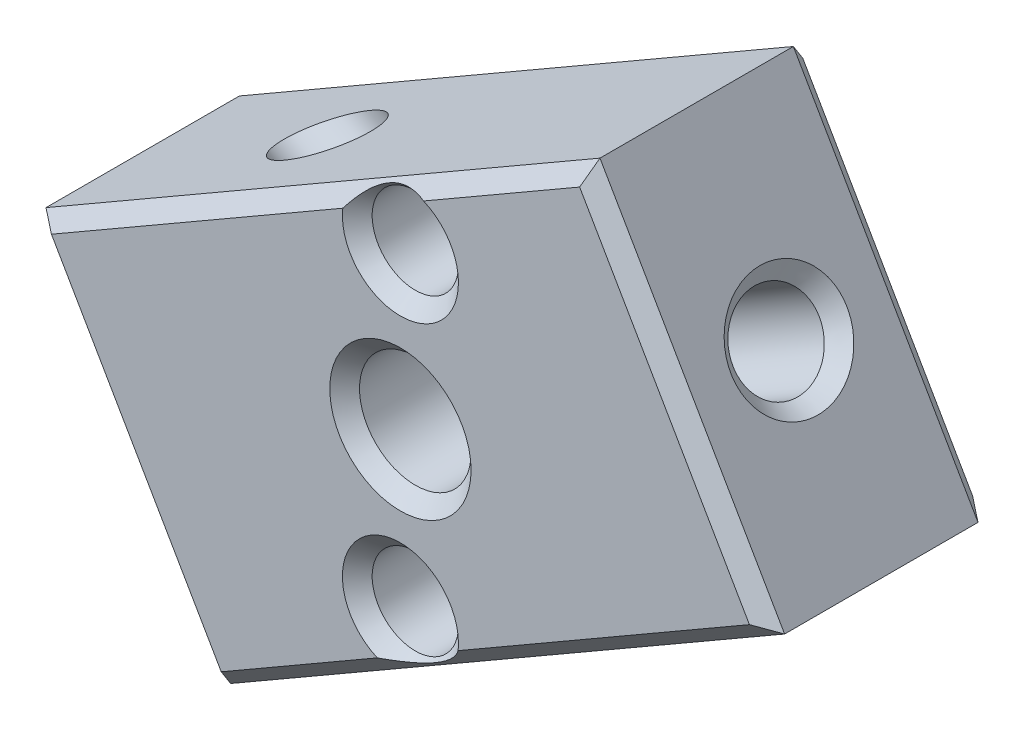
ISO-10303-21;
HEADER;
FILE_DESCRIPTION(('STEP AP214'),'2;1');
FILE_NAME('part.step','',(''),(''),'','','');
FILE_SCHEMA(('AUTOMOTIVE_DESIGN { 1 0 10303 214 1 1 1 1 }'));
ENDSEC;
DATA;
#1=APPLICATION_CONTEXT('core data for automotive mechanical design processes');
#2=APPLICATION_PROTOCOL_DEFINITION('international standard','automotive_design',2000,#1);
#3=PRODUCT_CONTEXT('',#1,'mechanical');
#4=PRODUCT('Part','Part','',(#3));
#5=PRODUCT_RELATED_PRODUCT_CATEGORY('part','',(#4));
#6=PRODUCT_DEFINITION_FORMATION('','',#4);
#7=PRODUCT_DEFINITION_CONTEXT('part definition',#1,'design');
#8=PRODUCT_DEFINITION('design','',#6,#7);
#9=PRODUCT_DEFINITION_SHAPE('','',#8);
#10=(LENGTH_UNIT() NAMED_UNIT(*) SI_UNIT(.MILLI.,.METRE.));
#11=(NAMED_UNIT(*) PLANE_ANGLE_UNIT() SI_UNIT($,.RADIAN.));
#12=(NAMED_UNIT(*) SI_UNIT($,.STERADIAN.) SOLID_ANGLE_UNIT());
#13=UNCERTAINTY_MEASURE_WITH_UNIT(LENGTH_MEASURE(1.E-05),#10,'distance_accuracy_value','');
#14=(GEOMETRIC_REPRESENTATION_CONTEXT(3) GLOBAL_UNCERTAINTY_ASSIGNED_CONTEXT((#13)) GLOBAL_UNIT_ASSIGNED_CONTEXT((#10,
#11,#12)) REPRESENTATION_CONTEXT('',''));
#15=CARTESIAN_POINT('',(0.,0.,0.));
#16=DIRECTION('',(0.,0.,1.));
#17=DIRECTION('',(1.,0.,0.));
#18=AXIS2_PLACEMENT_3D('',#15,#16,#17);
#19=CARTESIAN_POINT('',(-2.88675134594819,4.99999999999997,7.5));
#20=DIRECTION('',(0.866025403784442,-0.499999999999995,0.));
#21=DIRECTION('',(0.499999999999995,0.866025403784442,0.));
#22=AXIS2_PLACEMENT_3D('',#19,#20,#21);
#23=PLANE('',#22);
#24=DIRECTION('',(0.,0.,-1.));
#25=VECTOR('',#24,1.);
#26=CARTESIAN_POINT('',(-5.77350269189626,0.,7.5));
#27=LINE('',#26,#25);
#28=CARTESIAN_POINT('',(-5.77350269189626,0.,-2.5));
#29=VERTEX_POINT('',#28);
#30=CARTESIAN_POINT('',(-5.77350269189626,0.,-6.49999999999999));
#31=VERTEX_POINT('',#30);
#32=EDGE_CURVE('E925',#29,#31,#27,.T.);
#33=ORIENTED_EDGE('',*,*,#32,.T.);
#34=DIRECTION('',(0.499999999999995,0.866025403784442,0.));
#35=VECTOR('',#34,1.);
#36=CARTESIAN_POINT('',(-2.88675134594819,4.99999999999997,-6.49999999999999));
#37=LINE('',#36,#35);
#38=CARTESIAN_POINT('',(-2.88675134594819,4.99999999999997,-6.49999999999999));
#39=VERTEX_POINT('',#38);
#40=EDGE_CURVE('E558',#31,#39,#37,.T.);
#41=ORIENTED_EDGE('',*,*,#40,.T.);
#42=DIRECTION('',(0.,0.,-1.));
#43=VECTOR('',#42,1.);
#44=CARTESIAN_POINT('',(-2.88675134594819,4.99999999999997,7.5));
#45=LINE('',#44,#43);
#46=CARTESIAN_POINT('',(-2.88675134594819,4.99999999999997,-2.5));
#47=VERTEX_POINT('',#46);
#48=EDGE_CURVE('E912',#47,#39,#45,.T.);
#49=ORIENTED_EDGE('',*,*,#48,.F.);
#50=DIRECTION('',(-0.499999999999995,-0.866025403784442,0.));
#51=VECTOR('',#50,1.);
#52=CARTESIAN_POINT('',(-2.88675134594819,4.99999999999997,-2.5));
#53=LINE('',#52,#51);
#54=CARTESIAN_POINT('',(-3.59528009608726,3.7727922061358,-2.5));
#55=VERTEX_POINT('',#54);
#56=EDGE_CURVE('E272',#47,#55,#53,.T.);
#57=ORIENTED_EDGE('',*,*,#56,.T.);
#58=CARTESIAN_POINT('',(-4.33012701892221,2.50000000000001,0.));
#59=DIRECTION('',(0.866025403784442,-0.499999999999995,0.));
#60=DIRECTION('',(0.499999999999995,0.866025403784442,0.));
#61=AXIS2_PLACEMENT_3D('',#58,#59,#60);
#62=CIRCLE('',#61,2.9);
#63=CARTESIAN_POINT('',(-5.06497394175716,1.22720779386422,-2.5));
#64=VERTEX_POINT('',#63);
#65=EDGE_CURVE('E235',#55,#64,#62,.F.);
#66=ORIENTED_EDGE('',*,*,#65,.T.);
#67=EDGE_CURVE('E276',#64,#29,#53,.T.);
#68=ORIENTED_EDGE('',*,*,#67,.T.);
#69=EDGE_LOOP('',(#33,#41,#49,#57,#66,#68));
#70=FACE_BOUND('',#69,.T.);
#71=ADVANCED_FACE('F32',(#70),#23,.T.);
#72=CARTESIAN_POINT('',(2.88675134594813,-5.,7.5));
#73=DIRECTION('',(-0.866025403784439,0.5,0.));
#74=DIRECTION('',(-0.5,-0.866025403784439,0.));
#75=AXIS2_PLACEMENT_3D('',#72,#73,#74);
#76=PLANE('',#75);
#77=DIRECTION('',(0.,0.,-1.));
#78=VECTOR('',#77,1.);
#79=CARTESIAN_POINT('',(5.77350269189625,0.,7.5));
#80=LINE('',#79,#78);
#81=CARTESIAN_POINT('',(5.77350269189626,0.,-2.5));
#82=VERTEX_POINT('',#81);
#83=CARTESIAN_POINT('',(5.77350269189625,0.,-6.49999999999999));
#84=VERTEX_POINT('',#83);
#85=EDGE_CURVE('E918',#82,#84,#80,.T.);
#86=ORIENTED_EDGE('',*,*,#85,.T.);
#87=DIRECTION('',(-0.5,-0.866025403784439,0.));
#88=VECTOR('',#87,1.);
#89=CARTESIAN_POINT('',(2.88675134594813,-5.,-6.49999999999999));
#90=LINE('',#89,#88);
#91=CARTESIAN_POINT('',(2.88675134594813,-5.,-6.49999999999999));
#92=VERTEX_POINT('',#91);
#93=EDGE_CURVE('E554',#84,#92,#90,.T.);
#94=ORIENTED_EDGE('',*,*,#93,.T.);
#95=DIRECTION('',(0.,0.,-1.));
#96=VECTOR('',#95,1.);
#97=CARTESIAN_POINT('',(2.88675134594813,-5.,7.5));
#98=LINE('',#97,#96);
#99=CARTESIAN_POINT('',(2.88675134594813,-5.,-2.5));
#100=VERTEX_POINT('',#99);
#101=EDGE_CURVE('E921',#100,#92,#98,.T.);
#102=ORIENTED_EDGE('',*,*,#101,.F.);
#103=DIRECTION('',(0.5,0.866025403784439,0.));
#104=VECTOR('',#103,1.);
#105=CARTESIAN_POINT('',(2.88675134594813,-5.,-2.5));
#106=LINE('',#105,#104);
#107=CARTESIAN_POINT('',(3.59528009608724,-3.77279220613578,-2.5));
#108=VERTEX_POINT('',#107);
#109=EDGE_CURVE('E252',#100,#108,#106,.T.);
#110=ORIENTED_EDGE('',*,*,#109,.T.);
#111=CARTESIAN_POINT('',(4.33012701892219,-2.5,0.));
#112=DIRECTION('',(-0.866025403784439,0.5,0.));
#113=DIRECTION('',(-0.5,-0.866025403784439,0.));
#114=AXIS2_PLACEMENT_3D('',#111,#112,#113);
#115=CIRCLE('',#114,2.9);
#116=CARTESIAN_POINT('',(5.06497394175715,-1.22720779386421,-2.5));
#117=VERTEX_POINT('',#116);
#118=EDGE_CURVE('E897',#108,#117,#115,.F.);
#119=ORIENTED_EDGE('',*,*,#118,.T.);
#120=EDGE_CURVE('E244',#117,#82,#106,.T.);
#121=ORIENTED_EDGE('',*,*,#120,.T.);
#122=EDGE_LOOP('',(#86,#94,#102,#110,#119,#121));
#123=FACE_BOUND('',#122,.T.);
#124=ADVANCED_FACE('F325',(#123),#76,.T.);
#125=CARTESIAN_POINT('',(-27.9293192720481,-16.125,0.));
#126=DIRECTION('',(0.866025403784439,0.5,0.));
#127=DIRECTION('',(-0.5,0.866025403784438,0.));
#128=AXIS2_PLACEMENT_3D('',#125,#126,#127);
#129=CYLINDRICAL_SURFACE('',#128,2.9);
#130=CARTESIAN_POINT('',(17.753520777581,10.25,0.));
#131=DIRECTION('',(-0.866025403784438,-0.5,0.));
#132=DIRECTION('',(0.5,-0.866025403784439,0.));
#133=AXIS2_PLACEMENT_3D('',#130,#131,#132);
#134=CIRCLE('',#133,2.9);
#135=CARTESIAN_POINT('',(16.303520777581,12.7614736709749,0.));
#136=VERTEX_POINT('',#135);
#137=EDGE_CURVE('E41',#136,#136,#134,.F.);
#138=ORIENTED_EDGE('',*,*,#137,.T.);
#139=EDGE_LOOP('',(#138));
#140=FACE_BOUND('',#139,.T.);
#141=DIRECTION('',(0.866025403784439,0.5,0.));
#142=VECTOR('',#141,1.);
#143=CARTESIAN_POINT('',(-27.1944723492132,-17.3977922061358,-2.5));
#144=LINE('',#143,#142);
#145=CARTESIAN_POINT('',(5.77270360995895,1.63581570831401,-2.5));
#146=VERTEX_POINT('',#145);
#147=CARTESIAN_POINT('',(5.06497394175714,1.22720779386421,-2.5));
#148=VERTEX_POINT('',#147);
#149=EDGE_CURVE('E241',#146,#148,#144,.F.);
#150=ORIENTED_EDGE('',*,*,#149,.F.);
#151=CARTESIAN_POINT('',(5.77270360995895,1.63581570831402,-2.5));
#152=CARTESIAN_POINT('',(5.79305570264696,1.56400774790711,-2.45745305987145));
#153=CARTESIAN_POINT('',(5.81157584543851,1.49352670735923,-2.41190274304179));
#154=CARTESIAN_POINT('',(5.8452478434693,1.35576469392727,-2.31511178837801));
#155=CARTESIAN_POINT('',(5.86040057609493,1.2884828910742,-2.26387263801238));
#156=CARTESIAN_POINT('',(5.90129197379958,1.09207139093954,-2.10195463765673));
#157=CARTESIAN_POINT('',(5.92242504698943,0.968518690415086,-1.98315997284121));
#158=CARTESIAN_POINT('',(5.95515327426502,0.741198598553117,-1.72697101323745));
#159=CARTESIAN_POINT('',(5.96675010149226,0.637427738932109,-1.58957998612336));
#160=CARTESIAN_POINT('',(5.98347961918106,0.454364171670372,-1.29887478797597));
#161=CARTESIAN_POINT('',(5.98861730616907,0.3750525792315,-1.14557302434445));
#162=CARTESIAN_POINT('',(5.9935911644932,0.279011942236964,-0.908797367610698));
#163=CARTESIAN_POINT('',(5.99479490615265,0.251035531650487,-0.829776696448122));
#164=CARTESIAN_POINT('',(5.99662873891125,0.202571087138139,-0.669479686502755));
#165=CARTESIAN_POINT('',(5.99725913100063,0.182079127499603,-0.588204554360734));
#166=CARTESIAN_POINT('',(5.99817219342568,0.149021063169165,-0.424104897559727));
#167=CARTESIAN_POINT('',(5.99845509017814,0.136449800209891,-0.341281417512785));
#168=CARTESIAN_POINT('',(5.99881538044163,0.119482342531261,-0.174828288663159));
#169=CARTESIAN_POINT('',(5.99889279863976,0.115085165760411,-0.0911987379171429));
#170=CARTESIAN_POINT('',(5.99891478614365,0.114425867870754,0.140114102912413));
#171=CARTESIAN_POINT('',(5.99871265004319,0.126946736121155,0.287915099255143));
#172=CARTESIAN_POINT('',(5.99743684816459,0.177022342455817,0.579106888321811));
#173=CARTESIAN_POINT('',(5.99636301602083,0.214581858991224,0.722496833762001));
#174=CARTESIAN_POINT('',(5.99209227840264,0.311669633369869,0.999489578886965));
#175=CARTESIAN_POINT('',(5.98892242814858,0.370913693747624,1.13319331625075));
#176=CARTESIAN_POINT('',(5.97881266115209,0.508470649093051,1.39021703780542));
#177=CARTESIAN_POINT('',(5.97187136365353,0.586790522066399,1.51353319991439));
#178=CARTESIAN_POINT('',(5.95127938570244,0.769146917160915,1.76091572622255));
#179=CARTESIAN_POINT('',(5.93696702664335,0.875076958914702,1.88353327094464));
#180=CARTESIAN_POINT('',(5.89888978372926,1.10292546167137,2.11128587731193));
#181=CARTESIAN_POINT('',(5.87511959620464,1.22485286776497,2.21641108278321));
#182=CARTESIAN_POINT('',(5.81381917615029,1.48969833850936,2.41337082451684));
#183=CARTESIAN_POINT('',(5.77545394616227,1.63348375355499,2.50379118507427));
#184=CARTESIAN_POINT('',(5.68329716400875,1.92980448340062,2.65876895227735));
#185=CARTESIAN_POINT('',(5.62951404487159,2.0823349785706,2.7233404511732));
#186=CARTESIAN_POINT('',(5.50952668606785,2.38105747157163,2.820676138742));
#187=CARTESIAN_POINT('',(5.44426666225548,2.52707728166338,2.85512309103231));
#188=CARTESIAN_POINT('',(5.30039026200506,2.81636240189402,2.8968602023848));
#189=CARTESIAN_POINT('',(5.22178204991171,2.95962933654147,2.90416689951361));
#190=CARTESIAN_POINT('',(5.06090572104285,3.22636417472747,2.89183015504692));
#191=CARTESIAN_POINT('',(4.9795230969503,3.35047814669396,2.87443441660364));
#192=CARTESIAN_POINT('',(4.81050043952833,3.58893387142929,2.81744175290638));
#193=CARTESIAN_POINT('',(4.72286010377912,3.70327515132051,2.77784375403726));
#194=CARTESIAN_POINT('',(4.54403930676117,3.92067241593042,2.677677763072));
#195=CARTESIAN_POINT('',(4.4528390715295,4.02364771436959,2.61697114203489));
#196=CARTESIAN_POINT('',(4.2709403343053,4.21623534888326,2.47661308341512));
#197=CARTESIAN_POINT('',(4.18024201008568,4.30584320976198,2.396955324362));
#198=CARTESIAN_POINT('',(3.99508564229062,4.47846836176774,2.2129642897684));
#199=CARTESIAN_POINT('',(3.90099088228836,4.56022687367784,2.10708369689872));
#200=CARTESIAN_POINT('',(3.72200023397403,4.70745927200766,1.87757652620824));
#201=CARTESIAN_POINT('',(3.63711086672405,4.77292165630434,1.75393751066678));
#202=CARTESIAN_POINT('',(3.47635298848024,4.89137711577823,1.48289590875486));
#203=CARTESIAN_POINT('',(3.40139676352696,4.94331740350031,1.33448403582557));
#204=CARTESIAN_POINT('',(3.2733108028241,5.02905838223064,1.02365994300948));
#205=CARTESIAN_POINT('',(3.22016253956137,5.06287447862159,0.861259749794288));
#206=CARTESIAN_POINT('',(3.14378685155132,5.11062807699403,0.538637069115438));
#207=CARTESIAN_POINT('',(3.11876553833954,5.12576434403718,0.37902185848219));
#208=CARTESIAN_POINT('',(3.09508910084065,5.14010193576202,0.0571841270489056));
#209=CARTESIAN_POINT('',(3.09641465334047,5.13931493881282,-0.105036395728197));
#210=CARTESIAN_POINT('',(3.12368795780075,5.12276764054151,-0.409306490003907));
#211=CARTESIAN_POINT('',(3.1470402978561,5.10858545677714,-0.551688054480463));
#212=CARTESIAN_POINT('',(3.21263048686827,5.06759199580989,-0.830119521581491));
#213=CARTESIAN_POINT('',(3.25487314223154,5.04077750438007,-0.966167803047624));
#214=CARTESIAN_POINT('',(3.35693565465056,4.97341178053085,-1.23365564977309));
#215=CARTESIAN_POINT('',(3.41732381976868,4.93240867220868,-1.36476254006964));
#216=CARTESIAN_POINT('',(3.55124059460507,4.83688557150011,-1.61478181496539));
#217=CARTESIAN_POINT('',(3.6247782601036,4.78235625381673,-1.73368570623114));
#218=CARTESIAN_POINT('',(3.79403341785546,4.64958296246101,-1.97560146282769));
#219=CARTESIAN_POINT('',(3.8914141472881,4.56892838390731,-2.09615888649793));
#220=CARTESIAN_POINT('',(4.04273259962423,4.43406171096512,-2.26045901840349));
#221=CARTESIAN_POINT('',(4.09406902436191,4.38676952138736,-2.31248787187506));
#222=CARTESIAN_POINT('',(4.19785953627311,4.28755585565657,-2.41070494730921));
#223=CARTESIAN_POINT('',(4.25031377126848,4.23563376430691,-2.45689239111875));
#224=CARTESIAN_POINT('',(4.30300976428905,4.18140012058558,-2.5));
#225=B_SPLINE_CURVE_WITH_KNOTS('',3,(#151,#152,#153,#154,#155,#156,#157,#158,#159,#160,#161,
#162,#163,#164,#165,#166,#167,#168,#169,#170,#171,#172,#173,#174,#175,#176,#177,#178,#179,#180,
#181,#182,#183,#184,#185,#186,#187,#188,#189,#190,#191,#192,#193,#194,#195,#196,#197,#198,#199,
#200,#201,#202,#203,#204,#205,#206,#207,#208,#209,#210,#211,#212,#213,#214,#215,#216,#217,#218,
#219,#220,#221,#222,#223,#224),.UNSPECIFIED.,.F.,.F.,(4,2,2,2,2,2,2,2,2,2,2,2,2,2,2,2,2,2,2,2,2,
2,2,2,2,2,2,2,2,2,2,2,2,2,2,2,4),(0.,0.257550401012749,0.51503361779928,1.03050580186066,
1.5458875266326,2.06087032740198,2.31207588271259,2.56314948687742,2.81405941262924,
3.0649391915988,3.50751125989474,3.95016781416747,4.38721930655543,4.82443091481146,
5.31038131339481,5.79660460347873,6.31631812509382,6.83574792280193,7.32386538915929,
7.81168536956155,8.25785595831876,8.70404812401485,9.15322775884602,9.60255743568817,
10.0911235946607,10.5800336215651,11.0999194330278,11.6193626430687,12.1033685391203,
12.587019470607,13.0199751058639,13.4530409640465,13.9014080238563,14.35008506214,
14.8714402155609,15.1323342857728,15.3932630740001),.UNSPECIFIED.);
#226=CARTESIAN_POINT('',(4.30300976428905,4.18140012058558,-2.5));
#227=VERTEX_POINT('',#226);
#228=EDGE_CURVE('E228',#146,#227,#225,.T.);
#229=ORIENTED_EDGE('',*,*,#228,.T.);
#230=DIRECTION('',(0.866025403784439,0.5,0.));
#231=VECTOR('',#230,1.);
#232=CARTESIAN_POINT('',(-28.6641661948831,-14.8522077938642,-2.5));
#233=LINE('',#232,#231);
#234=CARTESIAN_POINT('',(3.59528009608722,3.77279220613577,-2.5));
#235=VERTEX_POINT('',#234);
#236=EDGE_CURVE('E243',#235,#227,#233,.T.);
#237=ORIENTED_EDGE('',*,*,#236,.F.);
#238=CARTESIAN_POINT('',(4.33012701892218,2.49999999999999,0.));
#239=DIRECTION('',(-0.866025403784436,-0.500000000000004,0.));
#240=DIRECTION('',(0.500000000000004,-0.866025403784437,0.));
#241=AXIS2_PLACEMENT_3D('',#238,#239,#240);
#242=CIRCLE('',#241,2.9);
#243=EDGE_CURVE('E251',#235,#148,#242,.T.);
#244=ORIENTED_EDGE('',*,*,#243,.T.);
#245=EDGE_LOOP('',(#150,#229,#237,#244));
#246=FACE_BOUND('',#245,.T.);
#247=ADVANCED_FACE('F249',(#140,#246),#129,.F.);
#248=CARTESIAN_POINT('',(-17.753520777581,-10.25,0.));
#249=DIRECTION('',(0.866025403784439,0.499999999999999,0.));
#250=DIRECTION('',(-0.499999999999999,0.866025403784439,0.));
#251=AXIS2_PLACEMENT_3D('',#248,#249,#250);
#252=CIRCLE('',#251,2.9);
#253=CARTESIAN_POINT('',(-19.2035207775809,-7.73852632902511,0.));
#254=VERTEX_POINT('',#253);
#255=EDGE_CURVE('E11',#254,#254,#252,.F.);
#256=ORIENTED_EDGE('',*,*,#255,.T.);
#257=EDGE_LOOP('',(#256));
#258=FACE_BOUND('',#257,.T.);
#259=DIRECTION('',(0.866025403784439,0.5,0.));
#260=VECTOR('',#259,1.);
#261=CARTESIAN_POINT('',(-27.1944723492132,-17.3977922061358,-2.5));
#262=LINE('',#261,#260);
#263=CARTESIAN_POINT('',(-3.59528009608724,-3.77279220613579,-2.5));
#264=VERTEX_POINT('',#263);
#265=CARTESIAN_POINT('',(-4.30300976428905,-4.18140012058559,-2.5));
#266=VERTEX_POINT('',#265);
#267=EDGE_CURVE('E266',#264,#266,#262,.F.);
#268=ORIENTED_EDGE('',*,*,#267,.F.);
#269=CARTESIAN_POINT('',(-4.33012701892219,-2.5,0.));
#270=DIRECTION('',(0.866025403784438,0.500000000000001,0.));
#271=DIRECTION('',(-0.500000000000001,0.866025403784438,0.));
#272=AXIS2_PLACEMENT_3D('',#269,#270,#271);
#273=CIRCLE('',#272,2.9);
#274=CARTESIAN_POINT('',(-5.06497394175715,-1.22720779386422,-2.5));
#275=VERTEX_POINT('',#274);
#276=EDGE_CURVE('E909',#264,#275,#273,.T.);
#277=ORIENTED_EDGE('',*,*,#276,.T.);
#278=DIRECTION('',(0.866025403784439,0.5,0.));
#279=VECTOR('',#278,1.);
#280=CARTESIAN_POINT('',(-28.6641661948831,-14.8522077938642,-2.5));
#281=LINE('',#280,#279);
#282=CARTESIAN_POINT('',(-5.77270360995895,-1.63581570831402,-2.5));
#283=VERTEX_POINT('',#282);
#284=EDGE_CURVE('E283',#283,#275,#281,.T.);
#285=ORIENTED_EDGE('',*,*,#284,.F.);
#286=CARTESIAN_POINT('',(-5.77270360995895,-1.63581570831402,-2.5));
#287=CARTESIAN_POINT('',(-5.79305570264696,-1.56400774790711,-2.45745305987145));
#288=CARTESIAN_POINT('',(-5.81157584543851,-1.49352670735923,-2.41190274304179));
#289=CARTESIAN_POINT('',(-5.8452478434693,-1.35576469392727,-2.31511178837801));
#290=CARTESIAN_POINT('',(-5.86040057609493,-1.2884828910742,-2.26387263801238));
#291=CARTESIAN_POINT('',(-5.90129197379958,-1.09207139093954,-2.10195463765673));
#292=CARTESIAN_POINT('',(-5.92242504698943,-0.968518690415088,-1.98315997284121));
#293=CARTESIAN_POINT('',(-5.95515327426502,-0.741198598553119,-1.72697101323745));
#294=CARTESIAN_POINT('',(-5.96675010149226,-0.637427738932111,-1.58957998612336));
#295=CARTESIAN_POINT('',(-5.98347961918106,-0.45436417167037,-1.29887478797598));
#296=CARTESIAN_POINT('',(-5.98861730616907,-0.375052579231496,-1.14557302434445));
#297=CARTESIAN_POINT('',(-5.9935911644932,-0.279011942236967,-0.908797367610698));
#298=CARTESIAN_POINT('',(-5.99479490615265,-0.251035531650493,-0.829776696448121));
#299=CARTESIAN_POINT('',(-5.99662873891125,-0.202571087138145,-0.669479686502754));
#300=CARTESIAN_POINT('',(-5.99725913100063,-0.182079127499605,-0.588204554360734));
#301=CARTESIAN_POINT('',(-5.99817219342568,-0.149021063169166,-0.424104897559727));
#302=CARTESIAN_POINT('',(-5.99845509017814,-0.136449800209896,-0.341281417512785));
#303=CARTESIAN_POINT('',(-5.99881538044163,-0.119482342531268,-0.174828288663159));
#304=CARTESIAN_POINT('',(-5.99889279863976,-0.115085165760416,-0.0911987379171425));
#305=CARTESIAN_POINT('',(-5.99891478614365,-0.114425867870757,0.140114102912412));
#306=CARTESIAN_POINT('',(-5.99871265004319,-0.126946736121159,0.287915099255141));
#307=CARTESIAN_POINT('',(-5.99743684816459,-0.177022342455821,0.579106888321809));
#308=CARTESIAN_POINT('',(-5.99636301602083,-0.214581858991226,0.722496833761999));
#309=CARTESIAN_POINT('',(-5.99209227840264,-0.31166963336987,0.999489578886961));
#310=CARTESIAN_POINT('',(-5.98892242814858,-0.370913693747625,1.13319331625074));
#311=CARTESIAN_POINT('',(-5.97881266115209,-0.508470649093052,1.39021703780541));
#312=CARTESIAN_POINT('',(-5.97187136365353,-0.586790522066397,1.51353319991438));
#313=CARTESIAN_POINT('',(-5.95127938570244,-0.769146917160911,1.76091572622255));
#314=CARTESIAN_POINT('',(-5.93696702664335,-0.8750769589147,1.88353327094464));
#315=CARTESIAN_POINT('',(-5.89888978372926,-1.10292546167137,2.11128587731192));
#316=CARTESIAN_POINT('',(-5.87511959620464,-1.22485286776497,2.21641108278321));
#317=CARTESIAN_POINT('',(-5.81381917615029,-1.48969833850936,2.41337082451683));
#318=CARTESIAN_POINT('',(-5.77545394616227,-1.63348375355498,2.50379118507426));
#319=CARTESIAN_POINT('',(-5.68329716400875,-1.92980448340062,2.65876895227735));
#320=CARTESIAN_POINT('',(-5.62951404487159,-2.0823349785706,2.7233404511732));
#321=CARTESIAN_POINT('',(-5.50952668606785,-2.38105747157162,2.820676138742));
#322=CARTESIAN_POINT('',(-5.44426666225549,-2.52707728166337,2.8551230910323));
#323=CARTESIAN_POINT('',(-5.30039026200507,-2.81636240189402,2.89686020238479));
#324=CARTESIAN_POINT('',(-5.22178204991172,-2.95962933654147,2.90416689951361));
#325=CARTESIAN_POINT('',(-5.06090572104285,-3.22636417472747,2.89183015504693));
#326=CARTESIAN_POINT('',(-4.97952309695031,-3.35047814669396,2.87443441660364));
#327=CARTESIAN_POINT('',(-4.81050043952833,-3.58893387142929,2.81744175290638));
#328=CARTESIAN_POINT('',(-4.72286010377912,-3.70327515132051,2.77784375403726));
#329=CARTESIAN_POINT('',(-4.54403930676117,-3.92067241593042,2.677677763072));
#330=CARTESIAN_POINT('',(-4.4528390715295,-4.02364771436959,2.61697114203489));
#331=CARTESIAN_POINT('',(-4.27094033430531,-4.21623534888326,2.47661308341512));
#332=CARTESIAN_POINT('',(-4.18024201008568,-4.30584320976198,2.396955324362));
#333=CARTESIAN_POINT('',(-3.99508564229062,-4.47846836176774,2.21296428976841));
#334=CARTESIAN_POINT('',(-3.90099088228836,-4.56022687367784,2.10708369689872));
#335=CARTESIAN_POINT('',(-3.72200023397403,-4.70745927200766,1.87757652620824));
#336=CARTESIAN_POINT('',(-3.63711086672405,-4.77292165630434,1.75393751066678));
#337=CARTESIAN_POINT('',(-3.47635298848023,-4.89137711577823,1.48289590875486));
#338=CARTESIAN_POINT('',(-3.40139676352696,-4.94331740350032,1.33448403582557));
#339=CARTESIAN_POINT('',(-3.2733108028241,-5.02905838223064,1.02365994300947));
#340=CARTESIAN_POINT('',(-3.22016253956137,-5.06287447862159,0.861259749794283));
#341=CARTESIAN_POINT('',(-3.14378685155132,-5.11062807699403,0.538637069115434));
#342=CARTESIAN_POINT('',(-3.11876553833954,-5.12576434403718,0.379021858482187));
#343=CARTESIAN_POINT('',(-3.09508910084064,-5.14010193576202,0.0571841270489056));
#344=CARTESIAN_POINT('',(-3.09641465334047,-5.13931493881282,-0.105036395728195));
#345=CARTESIAN_POINT('',(-3.12368795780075,-5.12276764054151,-0.409306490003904));
#346=CARTESIAN_POINT('',(-3.1470402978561,-5.10858545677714,-0.55168805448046));
#347=CARTESIAN_POINT('',(-3.21263048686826,-5.06759199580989,-0.830119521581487));
#348=CARTESIAN_POINT('',(-3.25487314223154,-5.04077750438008,-0.96616780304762));
#349=CARTESIAN_POINT('',(-3.35693565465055,-4.97341178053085,-1.23365564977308));
#350=CARTESIAN_POINT('',(-3.41732381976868,-4.93240867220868,-1.36476254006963));
#351=CARTESIAN_POINT('',(-3.55124059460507,-4.83688557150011,-1.61478181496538));
#352=CARTESIAN_POINT('',(-3.62477826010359,-4.78235625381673,-1.73368570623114));
#353=CARTESIAN_POINT('',(-3.79403341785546,-4.64958296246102,-1.97560146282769));
#354=CARTESIAN_POINT('',(-3.8914141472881,-4.56892838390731,-2.09615888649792));
#355=CARTESIAN_POINT('',(-4.04273259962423,-4.43406171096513,-2.26045901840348));
#356=CARTESIAN_POINT('',(-4.09406902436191,-4.38676952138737,-2.31248787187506));
#357=CARTESIAN_POINT('',(-4.19785953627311,-4.28755585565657,-2.41070494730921));
#358=CARTESIAN_POINT('',(-4.25031377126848,-4.23563376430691,-2.45689239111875));
#359=CARTESIAN_POINT('',(-4.30300976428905,-4.18140012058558,-2.5));
#360=B_SPLINE_CURVE_WITH_KNOTS('',3,(#286,#287,#288,#289,#290,#291,#292,#293,#294,#295,#296,
#297,#298,#299,#300,#301,#302,#303,#304,#305,#306,#307,#308,#309,#310,#311,#312,#313,#314,#315,
#316,#317,#318,#319,#320,#321,#322,#323,#324,#325,#326,#327,#328,#329,#330,#331,#332,#333,#334,
#335,#336,#337,#338,#339,#340,#341,#342,#343,#344,#345,#346,#347,#348,#349,#350,#351,#352,#353,
#354,#355,#356,#357,#358,#359),.UNSPECIFIED.,.F.,.F.,(4,2,2,2,2,2,2,2,2,2,2,2,2,2,2,2,2,2,2,2,2,
2,2,2,2,2,2,2,2,2,2,2,2,2,2,2,4),(0.,0.257550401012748,0.515033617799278,1.03050580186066,
1.5458875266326,2.06087032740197,2.31207588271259,2.56314948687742,2.81405941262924,
3.06493919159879,3.50751125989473,3.95016781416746,4.38721930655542,4.82443091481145,
5.3103813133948,5.79660460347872,6.31631812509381,6.83574792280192,7.32386538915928,
7.81168536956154,8.25785595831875,8.70404812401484,9.15322775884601,9.60255743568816,
10.0911235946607,10.5800336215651,11.0999194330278,11.6193626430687,12.1033685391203,
12.587019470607,13.0199751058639,13.4530409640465,13.9014080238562,14.35008506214,
14.8714402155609,15.1323342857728,15.3932630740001),.UNSPECIFIED.);
#361=EDGE_CURVE('E236',#283,#266,#360,.T.);
#362=ORIENTED_EDGE('',*,*,#361,.T.);
#363=EDGE_LOOP('',(#268,#277,#285,#362));
#364=FACE_BOUND('',#363,.T.);
#365=ADVANCED_FACE('F324',(#258,#364),#129,.F.);
#366=CARTESIAN_POINT('',(-5.77350269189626,0.,7.5));
#367=DIRECTION('',(0.866025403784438,0.500000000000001,0.));
#368=DIRECTION('',(-0.500000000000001,0.866025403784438,0.));
#369=AXIS2_PLACEMENT_3D('',#366,#367,#368);
#370=PLANE('',#369);
#371=DIRECTION('',(0.,0.,-1.));
#372=VECTOR('',#371,1.);
#373=CARTESIAN_POINT('',(-2.88675134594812,-5.00000000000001,7.5));
#374=LINE('',#373,#372);
#375=CARTESIAN_POINT('',(-2.88675134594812,-5.00000000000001,-2.5));
#376=VERTEX_POINT('',#375);
#377=CARTESIAN_POINT('',(-2.88675134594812,-5.00000000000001,-6.49999999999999));
#378=VERTEX_POINT('',#377);
#379=EDGE_CURVE('E923',#376,#378,#374,.T.);
#380=ORIENTED_EDGE('',*,*,#379,.T.);
#381=DIRECTION('',(-0.500000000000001,0.866025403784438,0.));
#382=VECTOR('',#381,1.);
#383=CARTESIAN_POINT('',(-5.77350269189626,0.,-6.49999999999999));
#384=LINE('',#383,#382);
#385=EDGE_CURVE('E49',#378,#31,#384,.T.);
#386=ORIENTED_EDGE('',*,*,#385,.T.);
#387=ORIENTED_EDGE('',*,*,#32,.F.);
#388=DIRECTION('',(0.500000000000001,-0.866025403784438,0.));
#389=VECTOR('',#388,1.);
#390=CARTESIAN_POINT('',(-5.77350269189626,0.,-2.5));
#391=LINE('',#390,#389);
#392=EDGE_CURVE('E267',#29,#275,#391,.T.);
#393=ORIENTED_EDGE('',*,*,#392,.T.);
#394=ORIENTED_EDGE('',*,*,#276,.F.);
#395=EDGE_CURVE('E263',#264,#376,#391,.T.);
#396=ORIENTED_EDGE('',*,*,#395,.T.);
#397=EDGE_LOOP('',(#380,#386,#387,#393,#394,#396));
#398=FACE_BOUND('',#397,.T.);
#399=ADVANCED_FACE('F351',(#398),#370,.T.);
#400=CARTESIAN_POINT('',(-2.88675134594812,-5.00000000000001,7.5));
#401=DIRECTION('',(0.,1.,0.));
#402=DIRECTION('',(-1.,0.,0.));
#403=AXIS2_PLACEMENT_3D('',#400,#401,#402);
#404=PLANE('',#403);
#405=ORIENTED_EDGE('',*,*,#101,.T.);
#406=DIRECTION('',(-1.,0.,0.));
#407=VECTOR('',#406,1.);
#408=CARTESIAN_POINT('',(-2.88675134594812,-5.00000000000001,-6.49999999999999));
#409=LINE('',#408,#407);
#410=EDGE_CURVE('E57',#92,#378,#409,.T.);
#411=ORIENTED_EDGE('',*,*,#410,.T.);
#412=ORIENTED_EDGE('',*,*,#379,.F.);
#413=DIRECTION('',(1.,0.,0.));
#414=VECTOR('',#413,1.);
#415=CARTESIAN_POINT('',(-2.88675134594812,-5.00000000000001,-2.5));
#416=LINE('',#415,#414);
#417=EDGE_CURVE('E256',#376,#100,#416,.T.);
#418=ORIENTED_EDGE('',*,*,#417,.T.);
#419=EDGE_LOOP('',(#405,#411,#412,#418));
#420=FACE_BOUND('',#419,.T.);
#421=ADVANCED_FACE('F344',(#420),#404,.T.);
#422=CARTESIAN_POINT('',(5.77350269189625,0.,7.5));
#423=DIRECTION('',(-0.866025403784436,-0.500000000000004,0.));
#424=DIRECTION('',(0.500000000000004,-0.866025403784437,0.));
#425=AXIS2_PLACEMENT_3D('',#422,#423,#424);
#426=PLANE('',#425);
#427=DIRECTION('',(0.,0.,-1.));
#428=VECTOR('',#427,1.);
#429=CARTESIAN_POINT('',(2.88675134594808,5.00000000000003,7.5));
#430=LINE('',#429,#428);
#431=CARTESIAN_POINT('',(2.88675134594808,5.00000000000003,-2.5));
#432=VERTEX_POINT('',#431);
#433=CARTESIAN_POINT('',(2.88675134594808,5.00000000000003,-6.49999999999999));
#434=VERTEX_POINT('',#433);
#435=EDGE_CURVE('E915',#432,#434,#430,.T.);
#436=ORIENTED_EDGE('',*,*,#435,.T.);
#437=DIRECTION('',(0.500000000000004,-0.866025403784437,0.));
#438=VECTOR('',#437,1.);
#439=CARTESIAN_POINT('',(5.77350269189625,0.,-6.49999999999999));
#440=LINE('',#439,#438);
#441=EDGE_CURVE('E552',#434,#84,#440,.T.);
#442=ORIENTED_EDGE('',*,*,#441,.T.);
#443=ORIENTED_EDGE('',*,*,#85,.F.);
#444=DIRECTION('',(-0.500000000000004,0.866025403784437,0.));
#445=VECTOR('',#444,1.);
#446=CARTESIAN_POINT('',(5.77350269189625,0.,-2.5));
#447=LINE('',#446,#445);
#448=EDGE_CURVE('E253',#82,#148,#447,.T.);
#449=ORIENTED_EDGE('',*,*,#448,.T.);
#450=ORIENTED_EDGE('',*,*,#243,.F.);
#451=EDGE_CURVE('E259',#235,#432,#447,.T.);
#452=ORIENTED_EDGE('',*,*,#451,.T.);
#453=EDGE_LOOP('',(#436,#442,#443,#449,#450,#452));
#454=FACE_BOUND('',#453,.T.);
#455=ADVANCED_FACE('F340',(#454),#426,.T.);
#456=CARTESIAN_POINT('',(2.88675134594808,5.00000000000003,7.5));
#457=DIRECTION('',(0.,-1.,0.));
#458=DIRECTION('',(1.,0.,0.));
#459=AXIS2_PLACEMENT_3D('',#456,#457,#458);
#460=PLANE('',#459);
#461=ORIENTED_EDGE('',*,*,#48,.T.);
#462=DIRECTION('',(1.,0.,0.));
#463=VECTOR('',#462,1.);
#464=CARTESIAN_POINT('',(2.88675134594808,5.00000000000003,-6.49999999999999));
#465=LINE('',#464,#463);
#466=EDGE_CURVE('E549',#39,#434,#465,.T.);
#467=ORIENTED_EDGE('',*,*,#466,.T.);
#468=ORIENTED_EDGE('',*,*,#435,.F.);
#469=DIRECTION('',(-1.,0.,0.));
#470=VECTOR('',#469,1.);
#471=CARTESIAN_POINT('',(2.88675134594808,5.00000000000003,-2.5));
#472=LINE('',#471,#470);
#473=EDGE_CURVE('E275',#432,#47,#472,.T.);
#474=ORIENTED_EDGE('',*,*,#473,.T.);
#475=EDGE_LOOP('',(#461,#467,#468,#474));
#476=FACE_BOUND('',#475,.T.);
#477=ADVANCED_FACE('F337',(#476),#460,.T.);
#478=CARTESIAN_POINT('',(-27.9293192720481,16.125,0.));
#479=DIRECTION('',(0.866025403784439,-0.5,0.));
#480=DIRECTION('',(0.5,0.866025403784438,0.));
#481=AXIS2_PLACEMENT_3D('',#478,#479,#480);
#482=CYLINDRICAL_SURFACE('',#481,2.9);
#483=CARTESIAN_POINT('',(-12.413030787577,7.16666666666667,0.));
#484=DIRECTION('',(0.5,-0.866025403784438,0.));
#485=DIRECTION('',(0.866025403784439,0.5,0.));
#486=AXIS2_PLACEMENT_3D('',#483,#484,#485);
#487=ELLIPSE('',#486,3.34863156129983,2.9);
#488=CARTESIAN_POINT('',(-9.51303078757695,8.84098244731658,0.));
#489=VERTEX_POINT('',#488);
#490=EDGE_CURVE('E902',#489,#489,#487,.F.);
#491=ORIENTED_EDGE('',*,*,#490,.T.);
#492=EDGE_LOOP('',(#491));
#493=FACE_BOUND('',#492,.T.);
#494=CARTESIAN_POINT('',(-5.77270360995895,1.63581570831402,-2.5));
#495=CARTESIAN_POINT('',(-5.79305570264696,1.56400774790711,-2.45745305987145));
#496=CARTESIAN_POINT('',(-5.81157584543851,1.49352670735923,-2.41190274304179));
#497=CARTESIAN_POINT('',(-5.8452478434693,1.35576469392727,-2.31511178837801));
#498=CARTESIAN_POINT('',(-5.86040057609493,1.2884828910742,-2.26387263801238));
#499=CARTESIAN_POINT('',(-5.90129197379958,1.09207139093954,-2.10195463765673));
#500=CARTESIAN_POINT('',(-5.92242504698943,0.968518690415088,-1.98315997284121));
#501=CARTESIAN_POINT('',(-5.95515327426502,0.741198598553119,-1.72697101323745));
#502=CARTESIAN_POINT('',(-5.96675010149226,0.637427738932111,-1.58957998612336));
#503=CARTESIAN_POINT('',(-5.98347961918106,0.45436417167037,-1.29887478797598));
#504=CARTESIAN_POINT('',(-5.98861730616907,0.375052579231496,-1.14557302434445));
#505=CARTESIAN_POINT('',(-5.9935911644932,0.279011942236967,-0.908797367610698));
#506=CARTESIAN_POINT('',(-5.99479490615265,0.251035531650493,-0.829776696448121));
#507=CARTESIAN_POINT('',(-5.99662873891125,0.202571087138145,-0.669479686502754));
#508=CARTESIAN_POINT('',(-5.99725913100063,0.182079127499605,-0.588204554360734));
#509=CARTESIAN_POINT('',(-5.99817219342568,0.149021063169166,-0.424104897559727));
#510=CARTESIAN_POINT('',(-5.99845509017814,0.136449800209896,-0.341281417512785));
#511=CARTESIAN_POINT('',(-5.99881538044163,0.119482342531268,-0.174828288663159));
#512=CARTESIAN_POINT('',(-5.99889279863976,0.115085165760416,-0.0911987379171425));
#513=CARTESIAN_POINT('',(-5.99891478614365,0.114425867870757,0.140114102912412));
#514=CARTESIAN_POINT('',(-5.99871265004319,0.126946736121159,0.287915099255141));
#515=CARTESIAN_POINT('',(-5.99743684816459,0.177022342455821,0.579106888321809));
#516=CARTESIAN_POINT('',(-5.99636301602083,0.214581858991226,0.722496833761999));
#517=CARTESIAN_POINT('',(-5.99209227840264,0.31166963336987,0.999489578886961));
#518=CARTESIAN_POINT('',(-5.98892242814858,0.370913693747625,1.13319331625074));
#519=CARTESIAN_POINT('',(-5.97881266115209,0.508470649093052,1.39021703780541));
#520=CARTESIAN_POINT('',(-5.97187136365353,0.586790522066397,1.51353319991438));
#521=CARTESIAN_POINT('',(-5.95127938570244,0.769146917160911,1.76091572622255));
#522=CARTESIAN_POINT('',(-5.93696702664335,0.8750769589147,1.88353327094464));
#523=CARTESIAN_POINT('',(-5.89888978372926,1.10292546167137,2.11128587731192));
#524=CARTESIAN_POINT('',(-5.87511959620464,1.22485286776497,2.21641108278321));
#525=CARTESIAN_POINT('',(-5.81381917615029,1.48969833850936,2.41337082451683));
#526=CARTESIAN_POINT('',(-5.77545394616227,1.63348375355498,2.50379118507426));
#527=CARTESIAN_POINT('',(-5.68329716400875,1.92980448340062,2.65876895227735));
#528=CARTESIAN_POINT('',(-5.62951404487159,2.0823349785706,2.7233404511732));
#529=CARTESIAN_POINT('',(-5.50952668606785,2.38105747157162,2.820676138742));
#530=CARTESIAN_POINT('',(-5.44426666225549,2.52707728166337,2.8551230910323));
#531=CARTESIAN_POINT('',(-5.30039026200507,2.81636240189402,2.89686020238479));
#532=CARTESIAN_POINT('',(-5.22178204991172,2.95962933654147,2.90416689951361));
#533=CARTESIAN_POINT('',(-5.06090572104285,3.22636417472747,2.89183015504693));
#534=CARTESIAN_POINT('',(-4.97952309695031,3.35047814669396,2.87443441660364));
#535=CARTESIAN_POINT('',(-4.81050043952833,3.58893387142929,2.81744175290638));
#536=CARTESIAN_POINT('',(-4.72286010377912,3.70327515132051,2.77784375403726));
#537=CARTESIAN_POINT('',(-4.54403930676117,3.92067241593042,2.677677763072));
#538=CARTESIAN_POINT('',(-4.4528390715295,4.02364771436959,2.61697114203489));
#539=CARTESIAN_POINT('',(-4.27094033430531,4.21623534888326,2.47661308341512));
#540=CARTESIAN_POINT('',(-4.18024201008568,4.30584320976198,2.396955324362));
#541=CARTESIAN_POINT('',(-3.99508564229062,4.47846836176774,2.21296428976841));
#542=CARTESIAN_POINT('',(-3.90099088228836,4.56022687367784,2.10708369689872));
#543=CARTESIAN_POINT('',(-3.72200023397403,4.70745927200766,1.87757652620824));
#544=CARTESIAN_POINT('',(-3.63711086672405,4.77292165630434,1.75393751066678));
#545=CARTESIAN_POINT('',(-3.47635298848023,4.89137711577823,1.48289590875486));
#546=CARTESIAN_POINT('',(-3.40139676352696,4.94331740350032,1.33448403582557));
#547=CARTESIAN_POINT('',(-3.2733108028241,5.02905838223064,1.02365994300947));
#548=CARTESIAN_POINT('',(-3.22016253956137,5.06287447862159,0.861259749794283));
#549=CARTESIAN_POINT('',(-3.14378685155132,5.11062807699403,0.538637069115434));
#550=CARTESIAN_POINT('',(-3.11876553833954,5.12576434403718,0.379021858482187));
#551=CARTESIAN_POINT('',(-3.09508910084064,5.14010193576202,0.0571841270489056));
#552=CARTESIAN_POINT('',(-3.09641465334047,5.13931493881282,-0.105036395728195));
#553=CARTESIAN_POINT('',(-3.12368795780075,5.12276764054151,-0.409306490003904));
#554=CARTESIAN_POINT('',(-3.1470402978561,5.10858545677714,-0.55168805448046));
#555=CARTESIAN_POINT('',(-3.21263048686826,5.06759199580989,-0.830119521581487));
#556=CARTESIAN_POINT('',(-3.25487314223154,5.04077750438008,-0.96616780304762));
#557=CARTESIAN_POINT('',(-3.35693565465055,4.97341178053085,-1.23365564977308));
#558=CARTESIAN_POINT('',(-3.41732381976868,4.93240867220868,-1.36476254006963));
#559=CARTESIAN_POINT('',(-3.55124059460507,4.83688557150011,-1.61478181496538));
#560=CARTESIAN_POINT('',(-3.62477826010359,4.78235625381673,-1.73368570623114));
#561=CARTESIAN_POINT('',(-3.79403341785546,4.64958296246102,-1.97560146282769));
#562=CARTESIAN_POINT('',(-3.8914141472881,4.56892838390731,-2.09615888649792));
#563=CARTESIAN_POINT('',(-4.04273259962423,4.43406171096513,-2.26045901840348));
#564=CARTESIAN_POINT('',(-4.09406902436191,4.38676952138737,-2.31248787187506));
#565=CARTESIAN_POINT('',(-4.19785953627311,4.28755585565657,-2.41070494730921));
#566=CARTESIAN_POINT('',(-4.25031377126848,4.23563376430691,-2.45689239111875));
#567=CARTESIAN_POINT('',(-4.30300976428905,4.18140012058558,-2.5));
#568=B_SPLINE_CURVE_WITH_KNOTS('',3,(#494,#495,#496,#497,#498,#499,#500,#501,#502,#503,#504,
#505,#506,#507,#508,#509,#510,#511,#512,#513,#514,#515,#516,#517,#518,#519,#520,#521,#522,#523,
#524,#525,#526,#527,#528,#529,#530,#531,#532,#533,#534,#535,#536,#537,#538,#539,#540,#541,#542,
#543,#544,#545,#546,#547,#548,#549,#550,#551,#552,#553,#554,#555,#556,#557,#558,#559,#560,#561,
#562,#563,#564,#565,#566,#567),.UNSPECIFIED.,.F.,.F.,(4,2,2,2,2,2,2,2,2,2,2,2,2,2,2,2,2,2,2,2,2,
2,2,2,2,2,2,2,2,2,2,2,2,2,2,2,4),(0.,0.257550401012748,0.515033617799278,1.03050580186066,
1.5458875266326,2.06087032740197,2.31207588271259,2.56314948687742,2.81405941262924,
3.06493919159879,3.50751125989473,3.95016781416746,4.38721930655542,4.82443091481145,
5.3103813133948,5.79660460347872,6.31631812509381,6.83574792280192,7.32386538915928,
7.81168536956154,8.25785595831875,8.70404812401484,9.15322775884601,9.60255743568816,
10.0911235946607,10.5800336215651,11.0999194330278,11.6193626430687,12.1033685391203,
12.587019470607,13.0199751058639,13.4530409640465,13.9014080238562,14.35008506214,
14.8714402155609,15.1323342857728,15.3932630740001),.UNSPECIFIED.);
#569=CARTESIAN_POINT('',(-5.77270360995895,1.63581570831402,-2.5));
#570=VERTEX_POINT('',#569);
#571=CARTESIAN_POINT('',(-4.30300976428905,4.18140012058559,-2.5));
#572=VERTEX_POINT('',#571);
#573=EDGE_CURVE('E285',#570,#572,#568,.T.);
#574=ORIENTED_EDGE('',*,*,#573,.F.);
#575=DIRECTION('',(0.866025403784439,-0.5,0.));
#576=VECTOR('',#575,1.);
#577=CARTESIAN_POINT('',(-28.6641661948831,14.8522077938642,-2.5));
#578=LINE('',#577,#576);
#579=EDGE_CURVE('E280',#570,#64,#578,.T.);
#580=ORIENTED_EDGE('',*,*,#579,.T.);
#581=ORIENTED_EDGE('',*,*,#65,.F.);
#582=DIRECTION('',(0.866025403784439,-0.5,0.));
#583=VECTOR('',#582,1.);
#584=CARTESIAN_POINT('',(-27.1944723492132,17.3977922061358,-2.5));
#585=LINE('',#584,#583);
#586=EDGE_CURVE('E269',#55,#572,#585,.F.);
#587=ORIENTED_EDGE('',*,*,#586,.T.);
#588=EDGE_LOOP('',(#574,#580,#581,#587));
#589=FACE_BOUND('',#588,.T.);
#590=ADVANCED_FACE('F296',(#493,#589),#482,.F.);
#591=CARTESIAN_POINT('',(12.413030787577,-7.16666666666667,0.));
#592=DIRECTION('',(-0.5,0.866025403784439,0.));
#593=DIRECTION('',(0.866025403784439,0.5,0.));
#594=AXIS2_PLACEMENT_3D('',#591,#592,#593);
#595=ELLIPSE('',#594,3.34863156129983,2.9);
#596=CARTESIAN_POINT('',(15.313030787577,-5.49235088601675,0.));
#597=VERTEX_POINT('',#596);
#598=EDGE_CURVE('E892',#597,#597,#595,.F.);
#599=ORIENTED_EDGE('',*,*,#598,.T.);
#600=EDGE_LOOP('',(#599));
#601=FACE_BOUND('',#600,.T.);
#602=ORIENTED_EDGE('',*,*,#118,.F.);
#603=DIRECTION('',(0.866025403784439,-0.5,0.));
#604=VECTOR('',#603,1.);
#605=CARTESIAN_POINT('',(-28.6641661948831,14.8522077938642,-2.5));
#606=LINE('',#605,#604);
#607=CARTESIAN_POINT('',(4.30300976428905,-4.18140012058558,-2.5));
#608=VERTEX_POINT('',#607);
#609=EDGE_CURVE('E899',#108,#608,#606,.T.);
#610=ORIENTED_EDGE('',*,*,#609,.T.);
#611=CARTESIAN_POINT('',(5.77270360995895,-1.63581570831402,-2.5));
#612=CARTESIAN_POINT('',(5.79305570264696,-1.56400774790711,-2.45745305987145));
#613=CARTESIAN_POINT('',(5.81157584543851,-1.49352670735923,-2.41190274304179));
#614=CARTESIAN_POINT('',(5.8452478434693,-1.35576469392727,-2.31511178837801));
#615=CARTESIAN_POINT('',(5.86040057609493,-1.2884828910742,-2.26387263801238));
#616=CARTESIAN_POINT('',(5.90129197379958,-1.09207139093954,-2.10195463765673));
#617=CARTESIAN_POINT('',(5.92242504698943,-0.968518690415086,-1.98315997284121));
#618=CARTESIAN_POINT('',(5.95515327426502,-0.741198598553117,-1.72697101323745));
#619=CARTESIAN_POINT('',(5.96675010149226,-0.637427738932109,-1.58957998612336));
#620=CARTESIAN_POINT('',(5.98347961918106,-0.454364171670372,-1.29887478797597));
#621=CARTESIAN_POINT('',(5.98861730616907,-0.3750525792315,-1.14557302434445));
#622=CARTESIAN_POINT('',(5.9935911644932,-0.279011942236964,-0.908797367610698));
#623=CARTESIAN_POINT('',(5.99479490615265,-0.251035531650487,-0.829776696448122));
#624=CARTESIAN_POINT('',(5.99662873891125,-0.202571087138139,-0.669479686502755));
#625=CARTESIAN_POINT('',(5.99725913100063,-0.182079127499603,-0.588204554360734));
#626=CARTESIAN_POINT('',(5.99817219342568,-0.149021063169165,-0.424104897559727));
#627=CARTESIAN_POINT('',(5.99845509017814,-0.136449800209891,-0.341281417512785));
#628=CARTESIAN_POINT('',(5.99881538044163,-0.119482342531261,-0.174828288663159));
#629=CARTESIAN_POINT('',(5.99889279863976,-0.115085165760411,-0.0911987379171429));
#630=CARTESIAN_POINT('',(5.99891478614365,-0.114425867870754,0.140114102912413));
#631=CARTESIAN_POINT('',(5.99871265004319,-0.126946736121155,0.287915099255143));
#632=CARTESIAN_POINT('',(5.99743684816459,-0.177022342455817,0.579106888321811));
#633=CARTESIAN_POINT('',(5.99636301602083,-0.214581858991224,0.722496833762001));
#634=CARTESIAN_POINT('',(5.99209227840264,-0.311669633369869,0.999489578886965));
#635=CARTESIAN_POINT('',(5.98892242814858,-0.370913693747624,1.13319331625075));
#636=CARTESIAN_POINT('',(5.97881266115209,-0.508470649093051,1.39021703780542));
#637=CARTESIAN_POINT('',(5.97187136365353,-0.586790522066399,1.51353319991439));
#638=CARTESIAN_POINT('',(5.95127938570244,-0.769146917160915,1.76091572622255));
#639=CARTESIAN_POINT('',(5.93696702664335,-0.875076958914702,1.88353327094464));
#640=CARTESIAN_POINT('',(5.89888978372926,-1.10292546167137,2.11128587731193));
#641=CARTESIAN_POINT('',(5.87511959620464,-1.22485286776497,2.21641108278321));
#642=CARTESIAN_POINT('',(5.81381917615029,-1.48969833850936,2.41337082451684));
#643=CARTESIAN_POINT('',(5.77545394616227,-1.63348375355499,2.50379118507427));
#644=CARTESIAN_POINT('',(5.68329716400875,-1.92980448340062,2.65876895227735));
#645=CARTESIAN_POINT('',(5.62951404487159,-2.0823349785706,2.7233404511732));
#646=CARTESIAN_POINT('',(5.50952668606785,-2.38105747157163,2.820676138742));
#647=CARTESIAN_POINT('',(5.44426666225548,-2.52707728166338,2.85512309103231));
#648=CARTESIAN_POINT('',(5.30039026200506,-2.81636240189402,2.8968602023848));
#649=CARTESIAN_POINT('',(5.22178204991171,-2.95962933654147,2.90416689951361));
#650=CARTESIAN_POINT('',(5.06090572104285,-3.22636417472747,2.89183015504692));
#651=CARTESIAN_POINT('',(4.9795230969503,-3.35047814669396,2.87443441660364));
#652=CARTESIAN_POINT('',(4.81050043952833,-3.58893387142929,2.81744175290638));
#653=CARTESIAN_POINT('',(4.72286010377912,-3.70327515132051,2.77784375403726));
#654=CARTESIAN_POINT('',(4.54403930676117,-3.92067241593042,2.677677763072));
#655=CARTESIAN_POINT('',(4.4528390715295,-4.02364771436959,2.61697114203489));
#656=CARTESIAN_POINT('',(4.2709403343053,-4.21623534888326,2.47661308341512));
#657=CARTESIAN_POINT('',(4.18024201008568,-4.30584320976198,2.396955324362));
#658=CARTESIAN_POINT('',(3.99508564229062,-4.47846836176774,2.2129642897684));
#659=CARTESIAN_POINT('',(3.90099088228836,-4.56022687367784,2.10708369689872));
#660=CARTESIAN_POINT('',(3.72200023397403,-4.70745927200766,1.87757652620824));
#661=CARTESIAN_POINT('',(3.63711086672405,-4.77292165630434,1.75393751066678));
#662=CARTESIAN_POINT('',(3.47635298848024,-4.89137711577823,1.48289590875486));
#663=CARTESIAN_POINT('',(3.40139676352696,-4.94331740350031,1.33448403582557));
#664=CARTESIAN_POINT('',(3.2733108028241,-5.02905838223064,1.02365994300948));
#665=CARTESIAN_POINT('',(3.22016253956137,-5.06287447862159,0.861259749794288));
#666=CARTESIAN_POINT('',(3.14378685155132,-5.11062807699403,0.538637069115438));
#667=CARTESIAN_POINT('',(3.11876553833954,-5.12576434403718,0.37902185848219));
#668=CARTESIAN_POINT('',(3.09508910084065,-5.14010193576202,0.0571841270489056));
#669=CARTESIAN_POINT('',(3.09641465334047,-5.13931493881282,-0.105036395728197));
#670=CARTESIAN_POINT('',(3.12368795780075,-5.12276764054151,-0.409306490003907));
#671=CARTESIAN_POINT('',(3.1470402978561,-5.10858545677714,-0.551688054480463));
#672=CARTESIAN_POINT('',(3.21263048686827,-5.06759199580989,-0.830119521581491));
#673=CARTESIAN_POINT('',(3.25487314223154,-5.04077750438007,-0.966167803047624));
#674=CARTESIAN_POINT('',(3.35693565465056,-4.97341178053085,-1.23365564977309));
#675=CARTESIAN_POINT('',(3.41732381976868,-4.93240867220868,-1.36476254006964));
#676=CARTESIAN_POINT('',(3.55124059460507,-4.83688557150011,-1.61478181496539));
#677=CARTESIAN_POINT('',(3.6247782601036,-4.78235625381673,-1.73368570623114));
#678=CARTESIAN_POINT('',(3.79403341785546,-4.64958296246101,-1.97560146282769));
#679=CARTESIAN_POINT('',(3.8914141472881,-4.56892838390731,-2.09615888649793));
#680=CARTESIAN_POINT('',(4.04273259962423,-4.43406171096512,-2.26045901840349));
#681=CARTESIAN_POINT('',(4.09406902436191,-4.38676952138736,-2.31248787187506));
#682=CARTESIAN_POINT('',(4.19785953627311,-4.28755585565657,-2.41070494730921));
#683=CARTESIAN_POINT('',(4.25031377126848,-4.23563376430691,-2.45689239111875));
#684=CARTESIAN_POINT('',(4.30300976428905,-4.18140012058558,-2.5));
#685=B_SPLINE_CURVE_WITH_KNOTS('',3,(#611,#612,#613,#614,#615,#616,#617,#618,#619,#620,#621,
#622,#623,#624,#625,#626,#627,#628,#629,#630,#631,#632,#633,#634,#635,#636,#637,#638,#639,#640,
#641,#642,#643,#644,#645,#646,#647,#648,#649,#650,#651,#652,#653,#654,#655,#656,#657,#658,#659,
#660,#661,#662,#663,#664,#665,#666,#667,#668,#669,#670,#671,#672,#673,#674,#675,#676,#677,#678,
#679,#680,#681,#682,#683,#684),.UNSPECIFIED.,.F.,.F.,(4,2,2,2,2,2,2,2,2,2,2,2,2,2,2,2,2,2,2,2,2,
2,2,2,2,2,2,2,2,2,2,2,2,2,2,2,4),(0.,0.257550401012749,0.51503361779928,1.03050580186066,
1.5458875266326,2.06087032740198,2.31207588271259,2.56314948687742,2.81405941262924,
3.0649391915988,3.50751125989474,3.95016781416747,4.38721930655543,4.82443091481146,
5.31038131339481,5.79660460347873,6.31631812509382,6.83574792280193,7.32386538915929,
7.81168536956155,8.25785595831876,8.70404812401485,9.15322775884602,9.60255743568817,
10.0911235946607,10.5800336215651,11.0999194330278,11.6193626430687,12.1033685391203,
12.587019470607,13.0199751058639,13.4530409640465,13.9014080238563,14.35008506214,
14.8714402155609,15.1323342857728,15.3932630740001),.UNSPECIFIED.);
#686=CARTESIAN_POINT('',(5.77270360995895,-1.63581570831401,-2.5));
#687=VERTEX_POINT('',#686);
#688=EDGE_CURVE('E309',#687,#608,#685,.T.);
#689=ORIENTED_EDGE('',*,*,#688,.F.);
#690=DIRECTION('',(0.866025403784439,-0.5,0.));
#691=VECTOR('',#690,1.);
#692=CARTESIAN_POINT('',(-27.1944723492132,17.3977922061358,-2.5));
#693=LINE('',#692,#691);
#694=EDGE_CURVE('E900',#687,#117,#693,.F.);
#695=ORIENTED_EDGE('',*,*,#694,.T.);
#696=EDGE_LOOP('',(#602,#610,#689,#695));
#697=FACE_BOUND('',#696,.T.);
#698=ADVANCED_FACE('F361',(#601,#697),#482,.F.);
#699=CARTESIAN_POINT('',(0.,0.,7.5));
#700=DIRECTION('',(0.,0.,1.));
#701=DIRECTION('',(1.,0.,0.));
#702=AXIS2_PLACEMENT_3D('',#699,#700,#701);
#703=PLANE('',#702);
#704=CARTESIAN_POINT('',(0.,0.,7.5));
#705=DIRECTION('',(0.,0.,1.));
#706=DIRECTION('',(1.,0.,0.));
#707=AXIS2_PLACEMENT_3D('',#704,#705,#706);
#708=CIRCLE('',#707,4.75);
#709=CARTESIAN_POINT('',(4.75,0.,7.5));
#710=VERTEX_POINT('',#709);
#711=EDGE_CURVE('E961',#710,#710,#708,.F.);
#712=ORIENTED_EDGE('',*,*,#711,.T.);
#713=EDGE_LOOP('',(#712));
#714=FACE_BOUND('',#713,.T.);
#715=CARTESIAN_POINT('',(0.,-10.5,7.5));
#716=DIRECTION('',(0.,0.,1.));
#717=DIRECTION('',(1.,0.,0.));
#718=AXIS2_PLACEMENT_3D('',#715,#716,#717);
#719=CIRCLE('',#718,3.9);
#720=CARTESIAN_POINT('',(-1.55517250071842,-14.0765120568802,7.5));
#721=VERTEX_POINT('',#720);
#722=CARTESIAN_POINT('',(3.87493654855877,-10.941437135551,7.5));
#723=VERTEX_POINT('',#722);
#724=EDGE_CURVE('E956',#721,#723,#719,.F.);
#725=ORIENTED_EDGE('',*,*,#724,.T.);
#726=DIRECTION('',(0.866025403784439,0.5,0.));
#727=VECTOR('',#726,1.);
#728=CARTESIAN_POINT('',(24.3260615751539,0.866025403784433,7.5));
#729=LINE('',#728,#727);
#730=CARTESIAN_POINT('',(23.4600361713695,0.366025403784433,7.5));
#731=VERTEX_POINT('',#730);
#732=EDGE_CURVE('E959',#723,#731,#729,.T.);
#733=ORIENTED_EDGE('',*,*,#732,.T.);
#734=DIRECTION('',(-0.5,0.866025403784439,0.));
#735=VECTOR('',#734,1.);
#736=CARTESIAN_POINT('',(11.5470053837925,21.,7.5));
#737=LINE('',#736,#735);
#738=CARTESIAN_POINT('',(12.0470053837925,20.1339745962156,7.5));
#739=VERTEX_POINT('',#738);
#740=EDGE_CURVE('E954',#731,#739,#737,.T.);
#741=ORIENTED_EDGE('',*,*,#740,.T.);
#742=DIRECTION('',(-0.866025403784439,-0.5,0.));
#743=VECTOR('',#742,1.);
#744=CARTESIAN_POINT('',(-24.3260615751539,-0.866025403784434,7.5));
#745=LINE('',#744,#743);
#746=CARTESIAN_POINT('',(1.55517250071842,14.0765120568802,7.5));
#747=VERTEX_POINT('',#746);
#748=EDGE_CURVE('E948',#739,#747,#745,.T.);
#749=ORIENTED_EDGE('',*,*,#748,.T.);
#750=CARTESIAN_POINT('',(0.,10.5,7.5));
#751=DIRECTION('',(0.,0.,1.));
#752=DIRECTION('',(1.,0.,0.));
#753=AXIS2_PLACEMENT_3D('',#750,#751,#752);
#754=CIRCLE('',#753,3.9);
#755=CARTESIAN_POINT('',(-3.87493654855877,10.941437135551,7.5));
#756=VERTEX_POINT('',#755);
#757=EDGE_CURVE('E942',#747,#756,#754,.F.);
#758=ORIENTED_EDGE('',*,*,#757,.T.);
#759=DIRECTION('',(-0.866025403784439,-0.5,0.));
#760=VECTOR('',#759,1.);
#761=CARTESIAN_POINT('',(-24.3260615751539,-0.866025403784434,7.5));
#762=LINE('',#761,#760);
#763=CARTESIAN_POINT('',(-23.4600361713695,-0.366025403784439,7.5));
#764=VERTEX_POINT('',#763);
#765=EDGE_CURVE('E946',#756,#764,#762,.T.);
#766=ORIENTED_EDGE('',*,*,#765,.T.);
#767=DIRECTION('',(0.5,-0.866025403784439,0.));
#768=VECTOR('',#767,1.);
#769=CARTESIAN_POINT('',(-11.5470053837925,-21.,7.5));
#770=LINE('',#769,#768);
#771=CARTESIAN_POINT('',(-12.0470053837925,-20.1339745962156,7.5));
#772=VERTEX_POINT('',#771);
#773=EDGE_CURVE('E950',#764,#772,#770,.T.);
#774=ORIENTED_EDGE('',*,*,#773,.T.);
#775=DIRECTION('',(0.866025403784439,0.5,0.));
#776=VECTOR('',#775,1.);
#777=CARTESIAN_POINT('',(24.3260615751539,0.866025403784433,7.5));
#778=LINE('',#777,#776);
#779=EDGE_CURVE('E952',#772,#721,#778,.T.);
#780=ORIENTED_EDGE('',*,*,#779,.T.);
#781=EDGE_LOOP('',(#725,#733,#741,#749,#758,#766,#774,#780));
#782=FACE_BOUND('',#781,.T.);
#783=ADVANCED_FACE('F357',(#714,#782),#703,.T.);
#784=CARTESIAN_POINT('',(0.,0.,-7.5));
#785=DIRECTION('',(0.,0.,1.));
#786=DIRECTION('',(1.,0.,0.));
#787=AXIS2_PLACEMENT_3D('',#784,#785,#786);
#788=PLANE('',#787);
#789=DIRECTION('',(-0.500000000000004,0.866025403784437,0.));
#790=VECTOR('',#789,1.);
#791=CARTESIAN_POINT('',(3.75277674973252,5.50000000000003,-7.5));
#792=LINE('',#791,#790);
#793=CARTESIAN_POINT('',(6.92820323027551,0.,-7.5));
#794=VERTEX_POINT('',#793);
#795=CARTESIAN_POINT('',(3.4641016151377,6.00000000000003,-7.5));
#796=VERTEX_POINT('',#795);
#797=EDGE_CURVE('E544',#794,#796,#792,.T.);
#798=ORIENTED_EDGE('',*,*,#797,.T.);
#799=DIRECTION('',(-1.,0.,0.));
#800=VECTOR('',#799,1.);
#801=CARTESIAN_POINT('',(-2.8867513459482,5.99999999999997,-7.5));
#802=LINE('',#801,#800);
#803=CARTESIAN_POINT('',(-3.46410161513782,5.99999999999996,-7.5));
#804=VERTEX_POINT('',#803);
#805=EDGE_CURVE('E546',#796,#804,#802,.T.);
#806=ORIENTED_EDGE('',*,*,#805,.T.);
#807=DIRECTION('',(-0.499999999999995,-0.866025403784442,0.));
#808=VECTOR('',#807,1.);
#809=CARTESIAN_POINT('',(-6.6395280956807,0.499999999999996,-7.5));
#810=LINE('',#809,#808);
#811=CARTESIAN_POINT('',(-6.92820323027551,0.,-7.5));
#812=VERTEX_POINT('',#811);
#813=EDGE_CURVE('E536',#804,#812,#810,.T.);
#814=ORIENTED_EDGE('',*,*,#813,.T.);
#815=DIRECTION('',(0.500000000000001,-0.866025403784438,0.));
#816=VECTOR('',#815,1.);
#817=CARTESIAN_POINT('',(-3.75277674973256,-5.50000000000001,-7.5));
#818=LINE('',#817,#816);
#819=CARTESIAN_POINT('',(-3.46410161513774,-6.00000000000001,-7.5));
#820=VERTEX_POINT('',#819);
#821=EDGE_CURVE('E538',#812,#820,#818,.T.);
#822=ORIENTED_EDGE('',*,*,#821,.T.);
#823=DIRECTION('',(1.,0.,0.));
#824=VECTOR('',#823,1.);
#825=CARTESIAN_POINT('',(2.88675134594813,-6.,-7.5));
#826=LINE('',#825,#824);
#827=CARTESIAN_POINT('',(3.46410161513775,-6.,-7.5));
#828=VERTEX_POINT('',#827);
#829=EDGE_CURVE('E540',#820,#828,#826,.T.);
#830=ORIENTED_EDGE('',*,*,#829,.T.);
#831=DIRECTION('',(0.5,0.866025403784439,0.));
#832=VECTOR('',#831,1.);
#833=CARTESIAN_POINT('',(6.63952809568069,-0.499999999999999,-7.5));
#834=LINE('',#833,#832);
#835=EDGE_CURVE('E542',#828,#794,#834,.T.);
#836=ORIENTED_EDGE('',*,*,#835,.T.);
#837=EDGE_LOOP('',(#798,#806,#814,#822,#830,#836));
#838=FACE_BOUND('',#837,.T.);
#839=DIRECTION('',(-0.866025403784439,-0.5,0.));
#840=VECTOR('',#839,1.);
#841=CARTESIAN_POINT('',(5.70651539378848,-9.88397459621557,-7.5));
#842=LINE('',#841,#840);
#843=CARTESIAN_POINT('',(-1.55517250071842,-14.0765120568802,-7.5));
#844=VERTEX_POINT('',#843);
#845=CARTESIAN_POINT('',(-12.0470053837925,-20.1339745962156,-7.5));
#846=VERTEX_POINT('',#845);
#847=EDGE_CURVE('E526',#844,#846,#842,.T.);
#848=ORIENTED_EDGE('',*,*,#847,.T.);
#849=DIRECTION('',(-0.5,0.866025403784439,0.));
#850=VECTOR('',#849,1.);
#851=CARTESIAN_POINT('',(-17.753520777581,-10.25,-7.5));
#852=LINE('',#851,#850);
#853=CARTESIAN_POINT('',(-23.4600361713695,-0.366025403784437,-7.5));
#854=VERTEX_POINT('',#853);
#855=EDGE_CURVE('E514',#846,#854,#852,.T.);
#856=ORIENTED_EDGE('',*,*,#855,.T.);
#857=DIRECTION('',(0.866025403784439,0.5,0.));
#858=VECTOR('',#857,1.);
#859=CARTESIAN_POINT('',(-5.70651539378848,9.88397459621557,-7.5));
#860=LINE('',#859,#858);
#861=CARTESIAN_POINT('',(-3.87493654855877,10.941437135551,-7.5));
#862=VERTEX_POINT('',#861);
#863=EDGE_CURVE('E521',#854,#862,#860,.T.);
#864=ORIENTED_EDGE('',*,*,#863,.T.);
#865=CARTESIAN_POINT('',(0.,10.5,-7.5));
#866=DIRECTION('',(0.,0.,1.));
#867=DIRECTION('',(1.,0.,0.));
#868=AXIS2_PLACEMENT_3D('',#865,#866,#867);
#869=CIRCLE('',#868,3.9);
#870=CARTESIAN_POINT('',(1.55517250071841,14.0765120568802,-7.5));
#871=VERTEX_POINT('',#870);
#872=EDGE_CURVE('E531',#862,#871,#869,.T.);
#873=ORIENTED_EDGE('',*,*,#872,.T.);
#874=DIRECTION('',(0.866025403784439,0.5,0.));
#875=VECTOR('',#874,1.);
#876=CARTESIAN_POINT('',(-5.70651539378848,9.88397459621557,-7.5));
#877=LINE('',#876,#875);
#878=CARTESIAN_POINT('',(12.0470053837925,20.1339745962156,-7.5));
#879=VERTEX_POINT('',#878);
#880=EDGE_CURVE('E997',#871,#879,#877,.T.);
#881=ORIENTED_EDGE('',*,*,#880,.T.);
#882=DIRECTION('',(0.5,-0.866025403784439,0.));
#883=VECTOR('',#882,1.);
#884=CARTESIAN_POINT('',(17.753520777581,10.25,-7.5));
#885=LINE('',#884,#883);
#886=CARTESIAN_POINT('',(23.4600361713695,0.366025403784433,-7.5));
#887=VERTEX_POINT('',#886);
#888=EDGE_CURVE('E999',#879,#887,#885,.T.);
#889=ORIENTED_EDGE('',*,*,#888,.T.);
#890=DIRECTION('',(-0.866025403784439,-0.5,0.));
#891=VECTOR('',#890,1.);
#892=CARTESIAN_POINT('',(5.70651539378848,-9.88397459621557,-7.5));
#893=LINE('',#892,#891);
#894=CARTESIAN_POINT('',(3.87493654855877,-10.941437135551,-7.5));
#895=VERTEX_POINT('',#894);
#896=EDGE_CURVE('E1001',#887,#895,#893,.T.);
#897=ORIENTED_EDGE('',*,*,#896,.T.);
#898=CARTESIAN_POINT('',(0.,-10.5,-7.5));
#899=DIRECTION('',(0.,0.,1.));
#900=DIRECTION('',(1.,0.,0.));
#901=AXIS2_PLACEMENT_3D('',#898,#899,#900);
#902=CIRCLE('',#901,3.9);
#903=EDGE_CURVE('E527',#895,#844,#902,.T.);
#904=ORIENTED_EDGE('',*,*,#903,.T.);
#905=EDGE_LOOP('',(#848,#856,#864,#873,#881,#889,#897,#904));
#906=FACE_BOUND('',#905,.T.);
#907=ADVANCED_FACE('F360',(#838,#906),#788,.F.);
#908=CARTESIAN_POINT('',(-24.8260615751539,0.,7.5));
#909=DIRECTION('',(0.5,-0.866025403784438,0.));
#910=DIRECTION('',(0.866025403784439,0.5,0.));
#911=AXIS2_PLACEMENT_3D('',#908,#909,#910);
#912=PLANE('',#911);
#913=ORIENTED_EDGE('',*,*,#490,.F.);
#914=EDGE_LOOP('',(#913));
#915=FACE_BOUND('',#914,.T.);
#916=DIRECTION('',(0.,0.,-1.));
#917=VECTOR('',#916,1.);
#918=CARTESIAN_POINT('',(-24.8260615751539,0.,7.5));
#919=LINE('',#918,#917);
#920=CARTESIAN_POINT('',(-24.8260615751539,0.,6.49999999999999));
#921=VERTEX_POINT('',#920);
#922=CARTESIAN_POINT('',(-24.8260615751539,0.,-6.50000000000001));
#923=VERTEX_POINT('',#922);
#924=EDGE_CURVE('E936',#921,#923,#919,.T.);
#925=ORIENTED_EDGE('',*,*,#924,.F.);
#926=DIRECTION('',(0.866025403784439,0.5,0.));
#927=VECTOR('',#926,1.);
#928=CARTESIAN_POINT('',(12.4130307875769,21.5,6.49999999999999));
#929=LINE('',#928,#927);
#930=CARTESIAN_POINT('',(12.4130307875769,21.5,6.49999999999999));
#931=VERTEX_POINT('',#930);
#932=EDGE_CURVE('E989',#921,#931,#929,.T.);
#933=ORIENTED_EDGE('',*,*,#932,.T.);
#934=DIRECTION('',(0.,0.,-1.));
#935=VECTOR('',#934,1.);
#936=CARTESIAN_POINT('',(12.4130307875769,21.5,7.5));
#937=LINE('',#936,#935);
#938=CARTESIAN_POINT('',(12.4130307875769,21.5,-6.50000000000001));
#939=VERTEX_POINT('',#938);
#940=EDGE_CURVE('E927',#931,#939,#937,.T.);
#941=ORIENTED_EDGE('',*,*,#940,.T.);
#942=DIRECTION('',(-0.866025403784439,-0.5,0.));
#943=VECTOR('',#942,1.);
#944=CARTESIAN_POINT('',(-24.8260615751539,0.,-6.50000000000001));
#945=LINE('',#944,#943);
#946=EDGE_CURVE('E520',#939,#923,#945,.T.);
#947=ORIENTED_EDGE('',*,*,#946,.T.);
#948=EDGE_LOOP('',(#925,#933,#941,#947));
#949=FACE_BOUND('',#948,.T.);
#950=ADVANCED_FACE('F365',(#915,#949),#912,.F.);
#951=CARTESIAN_POINT('',(-24.8260615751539,0.,7.5));
#952=DIRECTION('',(0.866025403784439,0.5,0.));
#953=DIRECTION('',(-0.5,0.866025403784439,0.));
#954=AXIS2_PLACEMENT_3D('',#951,#952,#953);
#955=PLANE('',#954);
#956=CARTESIAN_POINT('',(-18.6195461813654,-10.75,0.));
#957=DIRECTION('',(0.866025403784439,0.5,0.));
#958=DIRECTION('',(-0.5,0.866025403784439,0.));
#959=AXIS2_PLACEMENT_3D('',#956,#957,#958);
#960=CIRCLE('',#959,3.90000000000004);
#961=CARTESIAN_POINT('',(-20.5695461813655,-7.37250092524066,0.));
#962=VERTEX_POINT('',#961);
#963=EDGE_CURVE('E982',#962,#962,#960,.T.);
#964=ORIENTED_EDGE('',*,*,#963,.T.);
#965=EDGE_LOOP('',(#964));
#966=FACE_BOUND('',#965,.T.);
#967=DIRECTION('',(0.,0.,-1.));
#968=VECTOR('',#967,1.);
#969=CARTESIAN_POINT('',(-12.413030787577,-21.5,7.5));
#970=LINE('',#969,#968);
#971=CARTESIAN_POINT('',(-12.413030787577,-21.5,6.49999999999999));
#972=VERTEX_POINT('',#971);
#973=CARTESIAN_POINT('',(-12.413030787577,-21.5,-6.50000000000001));
#974=VERTEX_POINT('',#973);
#975=EDGE_CURVE('E933',#972,#974,#970,.T.);
#976=ORIENTED_EDGE('',*,*,#975,.F.);
#977=DIRECTION('',(-0.5,0.866025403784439,0.));
#978=VECTOR('',#977,1.);
#979=CARTESIAN_POINT('',(-24.8260615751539,0.,6.49999999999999));
#980=LINE('',#979,#978);
#981=EDGE_CURVE('E986',#972,#921,#980,.T.);
#982=ORIENTED_EDGE('',*,*,#981,.T.);
#983=ORIENTED_EDGE('',*,*,#924,.T.);
#984=DIRECTION('',(0.5,-0.866025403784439,0.));
#985=VECTOR('',#984,1.);
#986=CARTESIAN_POINT('',(-24.8260615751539,0.,-6.50000000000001));
#987=LINE('',#986,#985);
#988=EDGE_CURVE('E516',#923,#974,#987,.T.);
#989=ORIENTED_EDGE('',*,*,#988,.T.);
#990=EDGE_LOOP('',(#976,#982,#983,#989));
#991=FACE_BOUND('',#990,.T.);
#992=ADVANCED_FACE('F373',(#966,#991),#955,.F.);
#993=CARTESIAN_POINT('',(-12.413030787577,-21.5,7.5));
#994=DIRECTION('',(-0.5,0.866025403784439,0.));
#995=DIRECTION('',(-0.866025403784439,-0.5,0.));
#996=AXIS2_PLACEMENT_3D('',#993,#994,#995);
#997=PLANE('',#996);
#998=ORIENTED_EDGE('',*,*,#598,.F.);
#999=EDGE_LOOP('',(#998));
#1000=FACE_BOUND('',#999,.T.);
#1001=DIRECTION('',(0.,0.,-1.));
#1002=VECTOR('',#1001,1.);
#1003=CARTESIAN_POINT('',(24.8260615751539,0.,7.5));
#1004=LINE('',#1003,#1002);
#1005=CARTESIAN_POINT('',(24.8260615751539,0.,6.49999999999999));
#1006=VERTEX_POINT('',#1005);
#1007=CARTESIAN_POINT('',(24.8260615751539,0.,-6.50000000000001));
#1008=VERTEX_POINT('',#1007);
#1009=EDGE_CURVE('E930',#1006,#1008,#1004,.T.);
#1010=ORIENTED_EDGE('',*,*,#1009,.F.);
#1011=DIRECTION('',(-0.866025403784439,-0.5,0.));
#1012=VECTOR('',#1011,1.);
#1013=CARTESIAN_POINT('',(-12.413030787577,-21.5,6.49999999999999));
#1014=LINE('',#1013,#1012);
#1015=EDGE_CURVE('E980',#1006,#972,#1014,.T.);
#1016=ORIENTED_EDGE('',*,*,#1015,.T.);
#1017=ORIENTED_EDGE('',*,*,#975,.T.);
#1018=DIRECTION('',(0.866025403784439,0.5,0.));
#1019=VECTOR('',#1018,1.);
#1020=CARTESIAN_POINT('',(-12.413030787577,-21.5,-6.50000000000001));
#1021=LINE('',#1020,#1019);
#1022=EDGE_CURVE('E978',#974,#1008,#1021,.T.);
#1023=ORIENTED_EDGE('',*,*,#1022,.T.);
#1024=EDGE_LOOP('',(#1010,#1016,#1017,#1023));
#1025=FACE_BOUND('',#1024,.T.);
#1026=ADVANCED_FACE('F369',(#1000,#1025),#997,.F.);
#1027=CARTESIAN_POINT('',(24.8260615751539,0.,7.5));
#1028=DIRECTION('',(-0.866025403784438,-0.5,0.));
#1029=DIRECTION('',(0.5,-0.866025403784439,0.));
#1030=AXIS2_PLACEMENT_3D('',#1027,#1028,#1029);
#1031=PLANE('',#1030);
#1032=CARTESIAN_POINT('',(18.6195461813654,10.75,0.));
#1033=DIRECTION('',(-0.866025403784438,-0.5,0.));
#1034=DIRECTION('',(0.5,-0.866025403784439,0.));
#1035=AXIS2_PLACEMENT_3D('',#1032,#1033,#1034);
#1036=CIRCLE('',#1035,3.89999999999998);
#1037=CARTESIAN_POINT('',(16.6695461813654,14.1274990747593,0.));
#1038=VERTEX_POINT('',#1037);
#1039=EDGE_CURVE('E970',#1038,#1038,#1036,.T.);
#1040=ORIENTED_EDGE('',*,*,#1039,.T.);
#1041=EDGE_LOOP('',(#1040));
#1042=FACE_BOUND('',#1041,.T.);
#1043=ORIENTED_EDGE('',*,*,#940,.F.);
#1044=DIRECTION('',(0.5,-0.866025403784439,0.));
#1045=VECTOR('',#1044,1.);
#1046=CARTESIAN_POINT('',(24.8260615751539,0.,6.49999999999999));
#1047=LINE('',#1046,#1045);
#1048=EDGE_CURVE('E975',#931,#1006,#1047,.T.);
#1049=ORIENTED_EDGE('',*,*,#1048,.T.);
#1050=ORIENTED_EDGE('',*,*,#1009,.T.);
#1051=DIRECTION('',(-0.5,0.866025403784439,0.));
#1052=VECTOR('',#1051,1.);
#1053=CARTESIAN_POINT('',(24.8260615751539,0.,-6.50000000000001));
#1054=LINE('',#1053,#1052);
#1055=EDGE_CURVE('E973',#1008,#939,#1054,.T.);
#1056=ORIENTED_EDGE('',*,*,#1055,.T.);
#1057=EDGE_LOOP('',(#1043,#1049,#1050,#1056));
#1058=FACE_BOUND('',#1057,.T.);
#1059=ADVANCED_FACE('F335',(#1042,#1058),#1031,.F.);
#1060=CARTESIAN_POINT('',(0.,10.5,7.5));
#1061=DIRECTION('',(0.,0.,-1.));
#1062=DIRECTION('',(-1.,0.,0.));
#1063=AXIS2_PLACEMENT_3D('',#1060,#1061,#1062);
#1064=CYLINDRICAL_SURFACE('',#1063,2.9);
#1065=CARTESIAN_POINT('',(0.,10.5,6.50000000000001));
#1066=DIRECTION('',(0.,0.,1.));
#1067=DIRECTION('',(1.,0.,0.));
#1068=AXIS2_PLACEMENT_3D('',#1065,#1066,#1067);
#1069=CIRCLE('',#1068,2.9);
#1070=CARTESIAN_POINT('',(2.9,10.5,6.50000000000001));
#1071=VERTEX_POINT('',#1070);
#1072=EDGE_CURVE('E994',#1071,#1071,#1069,.T.);
#1073=ORIENTED_EDGE('',*,*,#1072,.T.);
#1074=EDGE_LOOP('',(#1073));
#1075=FACE_BOUND('',#1074,.T.);
#1076=CARTESIAN_POINT('',(0.,10.5,-6.5));
#1077=DIRECTION('',(0.,0.,1.));
#1078=DIRECTION('',(1.,0.,0.));
#1079=AXIS2_PLACEMENT_3D('',#1076,#1077,#1078);
#1080=CIRCLE('',#1079,2.9);
#1081=CARTESIAN_POINT('',(2.9,10.5,-6.5));
#1082=VERTEX_POINT('',#1081);
#1083=EDGE_CURVE('E991',#1082,#1082,#1080,.F.);
#1084=ORIENTED_EDGE('',*,*,#1083,.T.);
#1085=EDGE_LOOP('',(#1084));
#1086=FACE_BOUND('',#1085,.T.);
#1087=ADVANCED_FACE('F331',(#1075,#1086),#1064,.F.);
#1088=CARTESIAN_POINT('',(0.,-10.5,7.5));
#1089=DIRECTION('',(0.,0.,-1.));
#1090=DIRECTION('',(-1.,0.,0.));
#1091=AXIS2_PLACEMENT_3D('',#1088,#1089,#1090);
#1092=CYLINDRICAL_SURFACE('',#1091,2.9);
#1093=CARTESIAN_POINT('',(0.,-10.5,6.50000000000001));
#1094=DIRECTION('',(0.,0.,1.));
#1095=DIRECTION('',(1.,0.,0.));
#1096=AXIS2_PLACEMENT_3D('',#1093,#1094,#1095);
#1097=CIRCLE('',#1096,2.9);
#1098=CARTESIAN_POINT('',(2.9,-10.5,6.50000000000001));
#1099=VERTEX_POINT('',#1098);
#1100=EDGE_CURVE('E967',#1099,#1099,#1097,.T.);
#1101=ORIENTED_EDGE('',*,*,#1100,.T.);
#1102=EDGE_LOOP('',(#1101));
#1103=FACE_BOUND('',#1102,.T.);
#1104=CARTESIAN_POINT('',(0.,-10.5,-6.5));
#1105=DIRECTION('',(0.,0.,1.));
#1106=DIRECTION('',(1.,0.,0.));
#1107=AXIS2_PLACEMENT_3D('',#1104,#1105,#1106);
#1108=CIRCLE('',#1107,2.9);
#1109=CARTESIAN_POINT('',(2.9,-10.5,-6.5));
#1110=VERTEX_POINT('',#1109);
#1111=EDGE_CURVE('E964',#1110,#1110,#1108,.F.);
#1112=ORIENTED_EDGE('',*,*,#1111,.T.);
#1113=EDGE_LOOP('',(#1112));
#1114=FACE_BOUND('',#1113,.T.);
#1115=ADVANCED_FACE('F327',(#1103,#1114),#1092,.F.);
#1116=CARTESIAN_POINT('',(0.,0.,-2.5));
#1117=DIRECTION('',(0.,0.,1.));
#1118=DIRECTION('',(1.,0.,0.));
#1119=AXIS2_PLACEMENT_3D('',#1116,#1117,#1118);
#1120=CYLINDRICAL_SURFACE('',#1119,6.);
#1121=ORIENTED_EDGE('',*,*,#228,.F.);
#1122=CARTESIAN_POINT('',(0.,0.,-2.5));
#1123=DIRECTION('',(0.,0.,1.));
#1124=DIRECTION('',(1.,0.,0.));
#1125=AXIS2_PLACEMENT_3D('',#1122,#1123,#1124);
#1126=CIRCLE('',#1125,6.);
#1127=EDGE_CURVE('E231',#146,#227,#1126,.T.);
#1128=ORIENTED_EDGE('',*,*,#1127,.T.);
#1129=EDGE_LOOP('',(#1121,#1128));
#1130=FACE_BOUND('',#1129,.T.);
#1131=ADVANCED_FACE('F230',(#1130),#1120,.T.);
#1132=ORIENTED_EDGE('',*,*,#361,.F.);
#1133=EDGE_CURVE('E1046',#283,#266,#1126,.T.);
#1134=ORIENTED_EDGE('',*,*,#1133,.T.);
#1135=EDGE_LOOP('',(#1132,#1134));
#1136=FACE_BOUND('',#1135,.T.);
#1137=ADVANCED_FACE('F746',(#1136),#1120,.T.);
#1138=EDGE_CURVE('E245',#572,#570,#1126,.T.);
#1139=ORIENTED_EDGE('',*,*,#1138,.T.);
#1140=ORIENTED_EDGE('',*,*,#573,.T.);
#1141=EDGE_LOOP('',(#1139,#1140));
#1142=FACE_BOUND('',#1141,.T.);
#1143=ADVANCED_FACE('F304',(#1142),#1120,.T.);
#1144=CARTESIAN_POINT('',(0.,0.,-2.5));
#1145=DIRECTION('',(0.,0.,1.));
#1146=DIRECTION('',(1.,0.,0.));
#1147=AXIS2_PLACEMENT_3D('',#1144,#1145,#1146);
#1148=PLANE('',#1147);
#1149=CARTESIAN_POINT('',(0.,0.,-2.5));
#1150=DIRECTION('',(0.,0.,1.));
#1151=DIRECTION('',(1.,0.,0.));
#1152=AXIS2_PLACEMENT_3D('',#1149,#1150,#1151);
#1153=CIRCLE('',#1152,3.75);
#1154=CARTESIAN_POINT('',(3.75,0.,-2.5));
#1155=VERTEX_POINT('',#1154);
#1156=EDGE_CURVE('E419',#1155,#1155,#1153,.T.);
#1157=ORIENTED_EDGE('',*,*,#1156,.T.);
#1158=EDGE_LOOP('',(#1157));
#1159=FACE_BOUND('',#1158,.T.);
#1160=ORIENTED_EDGE('',*,*,#1133,.F.);
#1161=ORIENTED_EDGE('',*,*,#284,.T.);
#1162=ORIENTED_EDGE('',*,*,#392,.F.);
#1163=ORIENTED_EDGE('',*,*,#67,.F.);
#1164=ORIENTED_EDGE('',*,*,#579,.F.);
#1165=ORIENTED_EDGE('',*,*,#1138,.F.);
#1166=ORIENTED_EDGE('',*,*,#586,.F.);
#1167=ORIENTED_EDGE('',*,*,#56,.F.);
#1168=ORIENTED_EDGE('',*,*,#473,.F.);
#1169=ORIENTED_EDGE('',*,*,#451,.F.);
#1170=ORIENTED_EDGE('',*,*,#236,.T.);
#1171=ORIENTED_EDGE('',*,*,#1127,.F.);
#1172=ORIENTED_EDGE('',*,*,#149,.T.);
#1173=ORIENTED_EDGE('',*,*,#448,.F.);
#1174=ORIENTED_EDGE('',*,*,#120,.F.);
#1175=ORIENTED_EDGE('',*,*,#694,.F.);
#1176=EDGE_CURVE('E247',#608,#687,#1126,.T.);
#1177=ORIENTED_EDGE('',*,*,#1176,.F.);
#1178=ORIENTED_EDGE('',*,*,#609,.F.);
#1179=ORIENTED_EDGE('',*,*,#109,.F.);
#1180=ORIENTED_EDGE('',*,*,#417,.F.);
#1181=ORIENTED_EDGE('',*,*,#395,.F.);
#1182=ORIENTED_EDGE('',*,*,#267,.T.);
#1183=EDGE_LOOP('',(#1160,#1161,#1162,#1163,#1164,#1165,#1166,#1167,#1168,#1169,#1170,#1171,
#1172,#1173,#1174,#1175,#1177,#1178,#1179,#1180,#1181,#1182));
#1184=FACE_BOUND('',#1183,.T.);
#1185=ADVANCED_FACE('F240',(#1159,#1184),#1148,.F.);
#1186=ORIENTED_EDGE('',*,*,#1176,.T.);
#1187=ORIENTED_EDGE('',*,*,#688,.T.);
#1188=EDGE_LOOP('',(#1186,#1187));
#1189=FACE_BOUND('',#1188,.T.);
#1190=ADVANCED_FACE('F298',(#1189),#1120,.T.);
#1191=CARTESIAN_POINT('',(0.,0.,-2.5));
#1192=DIRECTION('',(0.,0.,1.));
#1193=DIRECTION('',(1.,0.,0.));
#1194=AXIS2_PLACEMENT_3D('',#1191,#1192,#1193);
#1195=CYLINDRICAL_SURFACE('',#1194,3.75);
#1196=CARTESIAN_POINT('',(0.,0.,6.50000000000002));
#1197=DIRECTION('',(0.,0.,1.));
#1198=DIRECTION('',(1.,0.,0.));
#1199=AXIS2_PLACEMENT_3D('',#1196,#1197,#1198);
#1200=CIRCLE('',#1199,3.75);
#1201=CARTESIAN_POINT('',(3.75,0.,6.50000000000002));
#1202=VERTEX_POINT('',#1201);
#1203=EDGE_CURVE('E940',#1202,#1202,#1200,.T.);
#1204=ORIENTED_EDGE('',*,*,#1203,.T.);
#1205=EDGE_LOOP('',(#1204));
#1206=FACE_BOUND('',#1205,.T.);
#1207=ORIENTED_EDGE('',*,*,#1156,.F.);
#1208=EDGE_LOOP('',(#1207));
#1209=FACE_BOUND('',#1208,.T.);
#1210=ADVANCED_FACE('F302',(#1206,#1209),#1195,.F.);
#1211=CARTESIAN_POINT('',(0.,0.,6.50000000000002));
#1212=DIRECTION('',(0.,0.,1.));
#1213=DIRECTION('',(1.,0.,0.));
#1214=AXIS2_PLACEMENT_3D('',#1211,#1212,#1213);
#1215=CONICAL_SURFACE('',#1214,3.75,0.785398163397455);
#1216=ORIENTED_EDGE('',*,*,#711,.F.);
#1217=EDGE_LOOP('',(#1216));
#1218=FACE_BOUND('',#1217,.T.);
#1219=ORIENTED_EDGE('',*,*,#1203,.F.);
#1220=EDGE_LOOP('',(#1219));
#1221=FACE_BOUND('',#1220,.T.);
#1222=ADVANCED_FACE('F381',(#1218,#1221),#1215,.F.);
#1223=CARTESIAN_POINT('',(0.,10.5,6.50000000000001));
#1224=DIRECTION('',(0.,0.,1.));
#1225=DIRECTION('',(1.,0.,0.));
#1226=AXIS2_PLACEMENT_3D('',#1223,#1224,#1225);
#1227=CONICAL_SURFACE('',#1226,2.9,0.785398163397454);
#1228=ORIENTED_EDGE('',*,*,#1072,.F.);
#1229=EDGE_LOOP('',(#1228));
#1230=FACE_BOUND('',#1229,.T.);
#1231=CARTESIAN_POINT('',(-3.87518015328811,10.9410655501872,7.5002));
#1232=CARTESIAN_POINT('',(-3.77854198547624,11.088454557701,7.42087645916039));
#1233=CARTESIAN_POINT('',(-3.67638514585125,11.2345847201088,7.34540244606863));
#1234=CARTESIAN_POINT('',(-3.45960019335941,11.523161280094,7.2038802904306));
#1235=CARTESIAN_POINT('',(-3.34492081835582,11.6655893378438,7.13787366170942));
#1236=CARTESIAN_POINT('',(-3.10164385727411,11.9452515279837,7.01731758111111));
#1237=CARTESIAN_POINT('',(-2.97295744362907,12.0824440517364,6.96284857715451));
#1238=CARTESIAN_POINT('',(-2.70210066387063,12.3478846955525,6.86839862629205));
#1239=CARTESIAN_POINT('',(-2.55995589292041,12.4761490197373,6.82839084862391));
#1240=CARTESIAN_POINT('',(-2.31432167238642,12.6785220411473,6.77594778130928));
#1241=CARTESIAN_POINT('',(-2.2145626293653,12.7559621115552,6.7587622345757));
#1242=CARTESIAN_POINT('',(-2.00992320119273,12.9051475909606,6.73188353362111));
#1243=CARTESIAN_POINT('',(-1.90504425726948,12.9768945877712,6.72218828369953));
#1244=CARTESIAN_POINT('',(-1.69136858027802,13.1136369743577,6.71060374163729));
#1245=CARTESIAN_POINT('',(-1.58259641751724,13.1786671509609,6.7086720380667));
#1246=CARTESIAN_POINT('',(-1.3613890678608,13.3018987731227,6.71255399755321));
#1247=CARTESIAN_POINT('',(-1.24895399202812,13.3601004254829,6.71836742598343));
#1248=CARTESIAN_POINT('',(-1.02151191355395,13.4692639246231,6.73755010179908));
#1249=CARTESIAN_POINT('',(-0.906509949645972,13.5202387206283,6.75090561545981));
#1250=CARTESIAN_POINT('',(-0.674621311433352,13.6149929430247,6.78479037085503));
#1251=CARTESIAN_POINT('',(-0.557734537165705,13.6587719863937,6.80531999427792));
#1252=CARTESIAN_POINT('',(-0.322348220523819,13.7394486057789,6.85314515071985));
#1253=CARTESIAN_POINT('',(-0.203843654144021,13.7763124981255,6.88047236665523));
#1254=CARTESIAN_POINT('',(0.0335523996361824,13.843207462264,6.94123765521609));
#1255=CARTESIAN_POINT('',(0.152443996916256,13.8732363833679,6.97467764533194));
#1256=CARTESIAN_POINT('',(0.379933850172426,13.9245859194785,7.04395256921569));
#1257=CARTESIAN_POINT('',(0.488551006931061,13.9464287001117,7.07934474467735));
#1258=CARTESIAN_POINT('',(0.705259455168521,13.9850846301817,7.15422195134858));
#1259=CARTESIAN_POINT('',(0.813350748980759,14.0018978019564,7.19370696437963));
#1260=CARTESIAN_POINT('',(1.0277113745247,14.0307330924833,7.27591518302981));
#1261=CARTESIAN_POINT('',(1.13398822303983,14.0427998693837,7.31860347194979));
#1262=CARTESIAN_POINT('',(1.34556302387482,14.0627281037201,7.4071325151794));
#1263=CARTESIAN_POINT('',(1.45086142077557,14.0705915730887,7.45297174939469));
#1264=CARTESIAN_POINT('',(1.55561610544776,14.0765372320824,7.5002));
#1265=B_SPLINE_CURVE_WITH_KNOTS('',3,(#1231,#1232,#1233,#1234,#1235,#1236,#1237,#1238,#1239,
#1240,#1241,#1242,#1243,#1244,#1245,#1246,#1247,#1248,#1249,#1250,#1251,#1252,#1253,#1254,#1255,
#1256,#1257,#1258,#1259,#1260,#1261,#1262,#1263,#1264),.UNSPECIFIED.,.F.,.F.,(4,2,2,2,2,2,2,2,2,
2,2,2,2,2,2,2,4),(0.,0.580033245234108,1.16253685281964,1.74897729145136,2.3343240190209,
2.71627968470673,3.09812844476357,3.47788834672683,3.85763674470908,4.23669586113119,
4.61577514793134,4.9966555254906,5.37765558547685,5.72638470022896,6.07511226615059,
6.42047537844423,6.76567303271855),.UNSPECIFIED.);
#1266=EDGE_CURVE('E411',#756,#747,#1265,.T.);
#1267=ORIENTED_EDGE('',*,*,#1266,.F.);
#1268=ORIENTED_EDGE('',*,*,#757,.F.);
#1269=EDGE_LOOP('',(#1267,#1268));
#1270=FACE_BOUND('',#1269,.T.);
#1271=ADVANCED_FACE('F384',(#1230,#1270),#1227,.F.);
#1272=CARTESIAN_POINT('',(-5.70651539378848,9.88397459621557,7.5));
#1273=DIRECTION('',(-0.353553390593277,0.612372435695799,0.707106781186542));
#1274=DIRECTION('',(0.866025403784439,0.5,0.));
#1275=AXIS2_PLACEMENT_3D('',#1272,#1273,#1274);
#1276=PLANE('',#1275);
#1277=ORIENTED_EDGE('',*,*,#1266,.T.);
#1278=ORIENTED_EDGE('',*,*,#748,.F.);
#1279=DIRECTION('',(0.211324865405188,0.788675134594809,-0.577350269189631));
#1280=VECTOR('',#1279,1.);
#1281=CARTESIAN_POINT('',(9.54583179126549,10.7994676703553,14.3333333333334));
#1282=LINE('',#1281,#1280);
#1283=EDGE_CURVE('E408',#931,#739,#1282,.F.);
#1284=ORIENTED_EDGE('',*,*,#1283,.F.);
#1285=ORIENTED_EDGE('',*,*,#932,.F.);
#1286=DIRECTION('',(0.788675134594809,-0.211324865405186,0.577350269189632));
#1287=VECTOR('',#1286,1.);
#1288=CARTESIAN_POINT('',(-14.1255292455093,-2.86719899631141,14.3333333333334));
#1289=LINE('',#1288,#1287);
#1290=EDGE_CURVE('E405',#764,#921,#1289,.F.);
#1291=ORIENTED_EDGE('',*,*,#1290,.F.);
#1292=ORIENTED_EDGE('',*,*,#765,.F.);
#1293=EDGE_LOOP('',(#1277,#1278,#1284,#1285,#1291,#1292));
#1294=FACE_BOUND('',#1293,.T.);
#1295=ADVANCED_FACE('F432',(#1294),#1276,.T.);
#1296=CARTESIAN_POINT('',(17.753520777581,10.25,7.5));
#1297=DIRECTION('',(0.612372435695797,0.353553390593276,0.707106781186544));
#1298=DIRECTION('',(0.5,-0.866025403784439,0.));
#1299=AXIS2_PLACEMENT_3D('',#1296,#1297,#1298);
#1300=PLANE('',#1299);
#1301=ORIENTED_EDGE('',*,*,#1283,.T.);
#1302=ORIENTED_EDGE('',*,*,#740,.F.);
#1303=DIRECTION('',(-0.78867513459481,0.211324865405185,0.57735026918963));
#1304=VECTOR('',#1303,1.);
#1305=CARTESIAN_POINT('',(14.1255292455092,2.8671989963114,14.3333333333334));
#1306=LINE('',#1305,#1304);
#1307=EDGE_CURVE('E402',#1006,#731,#1306,.T.);
#1308=ORIENTED_EDGE('',*,*,#1307,.F.);
#1309=ORIENTED_EDGE('',*,*,#1048,.F.);
#1310=EDGE_LOOP('',(#1301,#1302,#1308,#1309));
#1311=FACE_BOUND('',#1310,.T.);
#1312=ADVANCED_FACE('F435',(#1311),#1300,.T.);
#1313=CARTESIAN_POINT('',(-17.753520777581,-10.25,7.5));
#1314=DIRECTION('',(-0.6123724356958,-0.353553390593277,0.707106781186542));
#1315=DIRECTION('',(-0.5,0.866025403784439,0.));
#1316=AXIS2_PLACEMENT_3D('',#1313,#1314,#1315);
#1317=PLANE('',#1316);
#1318=ORIENTED_EDGE('',*,*,#1290,.T.);
#1319=ORIENTED_EDGE('',*,*,#981,.F.);
#1320=DIRECTION('',(0.211324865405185,0.788675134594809,0.577350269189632));
#1321=VECTOR('',#1320,1.);
#1322=CARTESIAN_POINT('',(-10.6545189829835,-14.9371445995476,11.304343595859));
#1323=LINE('',#1322,#1321);
#1324=EDGE_CURVE('E397',#772,#972,#1323,.F.);
#1325=ORIENTED_EDGE('',*,*,#1324,.F.);
#1326=ORIENTED_EDGE('',*,*,#773,.F.);
#1327=EDGE_LOOP('',(#1318,#1319,#1325,#1326));
#1328=FACE_BOUND('',#1327,.T.);
#1329=ADVANCED_FACE('F687',(#1328),#1317,.T.);
#1330=CARTESIAN_POINT('',(5.70651539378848,-9.88397459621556,7.5));
#1331=DIRECTION('',(0.353553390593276,-0.612372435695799,0.707106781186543));
#1332=DIRECTION('',(-0.866025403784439,-0.5,0.));
#1333=AXIS2_PLACEMENT_3D('',#1330,#1331,#1332);
#1334=PLANE('',#1333);
#1335=CARTESIAN_POINT('',(-1.55561610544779,-14.0765372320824,7.50020000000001));
#1336=CARTESIAN_POINT('',(-1.37965439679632,-14.066540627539,7.4208764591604));
#1337=CARTESIAN_POINT('',(-1.20202354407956,-14.0511352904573,7.34540244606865));
#1338=CARTESIAN_POINT('',(-0.843716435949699,-14.0076822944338,7.20388029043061));
#1339=CARTESIAN_POINT('',(-0.663030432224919,-13.9795810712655,7.13787366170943));
#1340=CARTESIAN_POINT('',(-0.299197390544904,-13.9087281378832,7.01731758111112));
#1341=CARTESIAN_POINT('',(-0.116041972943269,-13.865878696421,6.96284857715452));
#1342=CARTESIAN_POINT('',(0.249264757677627,-13.764030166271,6.86839862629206));
#1343=CARTESIAN_POINT('',(0.431417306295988,-13.7050613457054,6.82839084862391));
#1344=CARTESIAN_POINT('',(0.729494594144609,-13.5935223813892,6.77594778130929));
#1345=CARTESIAN_POINT('',(0.846439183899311,-13.5458485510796,6.7587622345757));
#1346=CARTESIAN_POINT('',(1.07795731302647,-13.443218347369,6.73188353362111));
#1347=CARTESIAN_POINT('',(1.19253150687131,-13.3882640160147,6.72218828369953));
#1348=CARTESIAN_POINT('',(1.41779172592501,-13.2715866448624,6.71060374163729));
#1349=CARTESIAN_POINT('',(1.52849559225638,-13.2099022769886,6.7086720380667));
#1350=CARTESIAN_POINT('',(1.74582098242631,-13.0799469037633,6.7125539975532));
#1351=CARTESIAN_POINT('',(1.85244262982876,-13.0116760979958,6.71836742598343));
#1352=CARTESIAN_POINT('',(2.06070203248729,-12.8692872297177,6.73755010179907));
#1353=CARTESIAN_POINT('',(2.16234848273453,-12.7951800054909,6.75090561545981));
#1354=CARTESIAN_POINT('',(2.36035236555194,-12.641735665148,6.78479037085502));
#1355=CARTESIAN_POINT('',(2.4567095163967,-12.5623982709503,6.80531999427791));
#1356=CARTESIAN_POINT('',(2.64427067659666,-12.3988860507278,6.85314515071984));
#1357=CARTESIAN_POINT('',(2.73544802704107,-12.3146900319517,6.88047236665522));
#1358=CARTESIAN_POINT('',(2.91207879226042,-12.1425465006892,6.94123765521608));
#1359=CARTESIAN_POINT('',(2.99753039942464,-12.0545978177,6.97467764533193));
#1360=CARTESIAN_POINT('',(3.15574532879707,-11.8832605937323,7.04395256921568));
#1361=CARTESIAN_POINT('',(3.22897031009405,-11.8001167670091,7.07934474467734));
#1362=CARTESIAN_POINT('',(3.37080155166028,-11.6317697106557,7.15422195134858));
#1363=CARTESIAN_POINT('',(3.43940783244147,-11.5465664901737,7.19370696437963));
#1364=CARTESIAN_POINT('',(3.57156023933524,-11.375342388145,7.27591518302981));
#1365=CARTESIAN_POINT('',(3.63514879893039,-11.289337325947,7.31860347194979));
#1366=CARTESIAN_POINT('',(3.75819455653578,-11.1160722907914,7.40713251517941));
#1367=CARTESIAN_POINT('',(3.81765371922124,-11.0288129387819,7.4529717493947));
#1368=CARTESIAN_POINT('',(3.87518015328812,-10.9410655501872,7.50020000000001));
#1369=B_SPLINE_CURVE_WITH_KNOTS('',3,(#1335,#1336,#1337,#1338,#1339,#1340,#1341,#1342,#1343,
#1344,#1345,#1346,#1347,#1348,#1349,#1350,#1351,#1352,#1353,#1354,#1355,#1356,#1357,#1358,#1359,
#1360,#1361,#1362,#1363,#1364,#1365,#1366,#1367,#1368),.UNSPECIFIED.,.F.,.F.,(4,2,2,2,2,2,2,2,2,
2,2,2,2,2,2,2,4),(0.,0.580033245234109,1.16253685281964,1.74897729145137,2.33432401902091,
2.71627968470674,3.09812844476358,3.47788834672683,3.85763674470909,4.2366958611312,
4.61577514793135,4.9966555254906,5.37765558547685,5.72638470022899,6.07511226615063,
6.42047537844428,6.76567303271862),.UNSPECIFIED.);
#1370=EDGE_CURVE('E392',#721,#723,#1369,.T.);
#1371=ORIENTED_EDGE('',*,*,#1370,.F.);
#1372=ORIENTED_EDGE('',*,*,#779,.F.);
#1373=ORIENTED_EDGE('',*,*,#1324,.T.);
#1374=ORIENTED_EDGE('',*,*,#1015,.F.);
#1375=ORIENTED_EDGE('',*,*,#1307,.T.);
#1376=ORIENTED_EDGE('',*,*,#732,.F.);
#1377=EDGE_LOOP('',(#1371,#1372,#1373,#1374,#1375,#1376));
#1378=FACE_BOUND('',#1377,.T.);
#1379=ADVANCED_FACE('F388',(#1378),#1334,.T.);
#1380=CARTESIAN_POINT('',(0.,-10.5,6.50000000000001));
#1381=DIRECTION('',(0.,0.,1.));
#1382=DIRECTION('',(1.,0.,0.));
#1383=AXIS2_PLACEMENT_3D('',#1380,#1381,#1382);
#1384=CONICAL_SURFACE('',#1383,2.9,0.785398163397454);
#1385=ORIENTED_EDGE('',*,*,#724,.F.);
#1386=ORIENTED_EDGE('',*,*,#1370,.T.);
#1387=EDGE_LOOP('',(#1385,#1386));
#1388=FACE_BOUND('',#1387,.T.);
#1389=ORIENTED_EDGE('',*,*,#1100,.F.);
#1390=EDGE_LOOP('',(#1389));
#1391=FACE_BOUND('',#1390,.T.);
#1392=ADVANCED_FACE('F461',(#1388,#1391),#1384,.F.);
#1393=CARTESIAN_POINT('',(0.,10.5,-7.5));
#1394=DIRECTION('',(0.,0.,-1.));
#1395=DIRECTION('',(-1.,0.,0.));
#1396=AXIS2_PLACEMENT_3D('',#1393,#1394,#1395);
#1397=CONICAL_SURFACE('',#1396,3.9,0.785398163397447);
#1398=ORIENTED_EDGE('',*,*,#1083,.F.);
#1399=EDGE_LOOP('',(#1398));
#1400=FACE_BOUND('',#1399,.T.);
#1401=CARTESIAN_POINT('',(-3.87518015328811,10.9410655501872,-7.5002));
#1402=CARTESIAN_POINT('',(-3.77854198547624,11.088454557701,-7.42087645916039));
#1403=CARTESIAN_POINT('',(-3.67638514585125,11.2345847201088,-7.34540244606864));
#1404=CARTESIAN_POINT('',(-3.45960019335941,11.523161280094,-7.2038802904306));
#1405=CARTESIAN_POINT('',(-3.34492081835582,11.6655893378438,-7.13787366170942));
#1406=CARTESIAN_POINT('',(-3.10164385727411,11.9452515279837,-7.01731758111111));
#1407=CARTESIAN_POINT('',(-2.97295744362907,12.0824440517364,-6.96284857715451));
#1408=CARTESIAN_POINT('',(-2.70210066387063,12.3478846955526,-6.86839862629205));
#1409=CARTESIAN_POINT('',(-2.55995589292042,12.4761490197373,-6.82839084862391));
#1410=CARTESIAN_POINT('',(-2.31432167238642,12.6785220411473,-6.77594778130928));
#1411=CARTESIAN_POINT('',(-2.21456262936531,12.7559621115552,-6.7587622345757));
#1412=CARTESIAN_POINT('',(-2.00992320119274,12.9051475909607,-6.73188353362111));
#1413=CARTESIAN_POINT('',(-1.90504425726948,12.9768945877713,-6.72218828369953));
#1414=CARTESIAN_POINT('',(-1.69136858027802,13.1136369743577,-6.71060374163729));
#1415=CARTESIAN_POINT('',(-1.58259641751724,13.1786671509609,-6.7086720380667));
#1416=CARTESIAN_POINT('',(-1.36138906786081,13.3018987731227,-6.71255399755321));
#1417=CARTESIAN_POINT('',(-1.24895399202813,13.3601004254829,-6.71836742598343));
#1418=CARTESIAN_POINT('',(-1.02151191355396,13.4692639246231,-6.73755010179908));
#1419=CARTESIAN_POINT('',(-0.906509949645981,13.5202387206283,-6.75090561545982));
#1420=CARTESIAN_POINT('',(-0.674621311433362,13.6149929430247,-6.78479037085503));
#1421=CARTESIAN_POINT('',(-0.557734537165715,13.6587719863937,-6.80531999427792));
#1422=CARTESIAN_POINT('',(-0.32234822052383,13.7394486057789,-6.85314515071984));
#1423=CARTESIAN_POINT('',(-0.203843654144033,13.7763124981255,-6.88047236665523));
#1424=CARTESIAN_POINT('',(0.0335523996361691,13.843207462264,-6.94123765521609));
#1425=CARTESIAN_POINT('',(0.152443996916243,13.8732363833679,-6.97467764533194));
#1426=CARTESIAN_POINT('',(0.379933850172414,13.9245859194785,-7.04395256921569));
#1427=CARTESIAN_POINT('',(0.48855100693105,13.9464287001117,-7.07934474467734));
#1428=CARTESIAN_POINT('',(0.705259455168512,13.9850846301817,-7.15422195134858));
#1429=CARTESIAN_POINT('',(0.813350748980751,14.0018978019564,-7.19370696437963));
#1430=CARTESIAN_POINT('',(1.02771137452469,14.0307330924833,-7.27591518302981));
#1431=CARTESIAN_POINT('',(1.13398822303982,14.0427998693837,-7.31860347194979));
#1432=CARTESIAN_POINT('',(1.34556302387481,14.0627281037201,-7.4071325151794));
#1433=CARTESIAN_POINT('',(1.45086142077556,14.0705915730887,-7.45297174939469));
#1434=CARTESIAN_POINT('',(1.55561610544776,14.0765372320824,-7.5002));
#1435=B_SPLINE_CURVE_WITH_KNOTS('',3,(#1401,#1402,#1403,#1404,#1405,#1406,#1407,#1408,#1409,
#1410,#1411,#1412,#1413,#1414,#1415,#1416,#1417,#1418,#1419,#1420,#1421,#1422,#1423,#1424,#1425,
#1426,#1427,#1428,#1429,#1430,#1431,#1432,#1433,#1434),.UNSPECIFIED.,.F.,.F.,(4,2,2,2,2,2,2,2,2,
2,2,2,2,2,2,2,4),(0.,0.58003324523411,1.16253685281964,1.74897729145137,2.33432401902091,
2.71627968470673,3.09812844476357,3.47788834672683,3.85763674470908,4.2366958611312,
4.61577514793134,4.99665552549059,5.37765558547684,5.72638470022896,6.07511226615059,
6.42047537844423,6.76567303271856),.UNSPECIFIED.);
#1436=EDGE_CURVE('E398',#871,#862,#1435,.F.);
#1437=ORIENTED_EDGE('',*,*,#1436,.F.);
#1438=ORIENTED_EDGE('',*,*,#872,.F.);
#1439=EDGE_LOOP('',(#1437,#1438));
#1440=FACE_BOUND('',#1439,.T.);
#1441=ADVANCED_FACE('F457',(#1400,#1440),#1397,.F.);
#1442=CARTESIAN_POINT('',(-24.8260615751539,0.,-6.50000000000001));
#1443=DIRECTION('',(0.353553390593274,-0.612372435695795,0.707106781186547));
#1444=DIRECTION('',(-0.866025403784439,-0.5,0.));
#1445=AXIS2_PLACEMENT_3D('',#1442,#1443,#1444);
#1446=PLANE('',#1445);
#1447=ORIENTED_EDGE('',*,*,#1436,.T.);
#1448=ORIENTED_EDGE('',*,*,#863,.F.);
#1449=DIRECTION('',(-0.788675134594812,0.211324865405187,0.577350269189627));
#1450=VECTOR('',#1449,1.);
#1451=CARTESIAN_POINT('',(-24.8260615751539,0.,-6.50000000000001));
#1452=LINE('',#1451,#1450);
#1453=EDGE_CURVE('E472',#923,#854,#1452,.F.);
#1454=ORIENTED_EDGE('',*,*,#1453,.F.);
#1455=ORIENTED_EDGE('',*,*,#946,.F.);
#1456=DIRECTION('',(-0.211324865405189,-0.788675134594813,-0.577350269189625));
#1457=VECTOR('',#1456,1.);
#1458=CARTESIAN_POINT('',(7.16666666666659,1.92030254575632,-20.8333333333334));
#1459=LINE('',#1458,#1457);
#1460=EDGE_CURVE('E503',#879,#939,#1459,.F.);
#1461=ORIENTED_EDGE('',*,*,#1460,.F.);
#1462=ORIENTED_EDGE('',*,*,#880,.F.);
#1463=EDGE_LOOP('',(#1447,#1448,#1454,#1455,#1461,#1462));
#1464=FACE_BOUND('',#1463,.T.);
#1465=ADVANCED_FACE('F455',(#1464),#1446,.F.);
#1466=CARTESIAN_POINT('',(-24.8260615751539,0.,-6.50000000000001));
#1467=DIRECTION('',(0.612372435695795,0.353553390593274,0.707106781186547));
#1468=DIRECTION('',(0.5,-0.866025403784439,0.));
#1469=AXIS2_PLACEMENT_3D('',#1466,#1467,#1468);
#1470=PLANE('',#1469);
#1471=ORIENTED_EDGE('',*,*,#1453,.T.);
#1472=ORIENTED_EDGE('',*,*,#855,.F.);
#1473=DIRECTION('',(0.211324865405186,0.788675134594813,-0.577350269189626));
#1474=VECTOR('',#1473,1.);
#1475=CARTESIAN_POINT('',(-12.413030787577,-21.5,-6.50000000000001));
#1476=LINE('',#1475,#1474);
#1477=EDGE_CURVE('E499',#974,#846,#1476,.T.);
#1478=ORIENTED_EDGE('',*,*,#1477,.F.);
#1479=ORIENTED_EDGE('',*,*,#988,.F.);
#1480=EDGE_LOOP('',(#1471,#1472,#1478,#1479));
#1481=FACE_BOUND('',#1480,.T.);
#1482=ADVANCED_FACE('F451',(#1481),#1470,.F.);
#1483=CARTESIAN_POINT('',(24.8260615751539,0.,-6.50000000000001));
#1484=DIRECTION('',(-0.612372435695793,-0.353553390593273,0.707106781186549));
#1485=DIRECTION('',(-0.5,0.866025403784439,0.));
#1486=AXIS2_PLACEMENT_3D('',#1483,#1484,#1485);
#1487=PLANE('',#1486);
#1488=ORIENTED_EDGE('',*,*,#1460,.T.);
#1489=ORIENTED_EDGE('',*,*,#1055,.F.);
#1490=DIRECTION('',(-0.788675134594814,0.211324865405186,-0.577350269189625));
#1491=VECTOR('',#1490,1.);
#1492=CARTESIAN_POINT('',(24.8260615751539,0.,-6.50000000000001));
#1493=LINE('',#1492,#1491);
#1494=EDGE_CURVE('E493',#887,#1008,#1493,.F.);
#1495=ORIENTED_EDGE('',*,*,#1494,.F.);
#1496=ORIENTED_EDGE('',*,*,#888,.F.);
#1497=EDGE_LOOP('',(#1488,#1489,#1495,#1496));
#1498=FACE_BOUND('',#1497,.T.);
#1499=ADVANCED_FACE('F443',(#1498),#1487,.F.);
#1500=CARTESIAN_POINT('',(-12.413030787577,-21.5,-6.50000000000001));
#1501=DIRECTION('',(-0.353553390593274,0.612372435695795,0.707106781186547));
#1502=DIRECTION('',(0.866025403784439,0.5,0.));
#1503=AXIS2_PLACEMENT_3D('',#1500,#1501,#1502);
#1504=PLANE('',#1503);
#1505=CARTESIAN_POINT('',(3.87518015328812,-10.9410655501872,-7.50020000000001));
#1506=CARTESIAN_POINT('',(3.77854198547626,-11.088454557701,-7.4208764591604));
#1507=CARTESIAN_POINT('',(3.67638514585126,-11.2345847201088,-7.34540244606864));
#1508=CARTESIAN_POINT('',(3.45960019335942,-11.523161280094,-7.20388029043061));
#1509=CARTESIAN_POINT('',(3.34492081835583,-11.6655893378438,-7.13787366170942));
#1510=CARTESIAN_POINT('',(3.10164385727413,-11.9452515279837,-7.01731758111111));
#1511=CARTESIAN_POINT('',(2.97295744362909,-12.0824440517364,-6.96284857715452));
#1512=CARTESIAN_POINT('',(2.70210066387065,-12.3478846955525,-6.86839862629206));
#1513=CARTESIAN_POINT('',(2.55995589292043,-12.4761490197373,-6.82839084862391));
#1514=CARTESIAN_POINT('',(2.31432167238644,-12.6785220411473,-6.77594778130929));
#1515=CARTESIAN_POINT('',(2.21456262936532,-12.7559621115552,-6.7587622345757));
#1516=CARTESIAN_POINT('',(2.00992320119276,-12.9051475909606,-6.73188353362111));
#1517=CARTESIAN_POINT('',(1.9050442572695,-12.9768945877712,-6.72218828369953));
#1518=CARTESIAN_POINT('',(1.69136858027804,-13.1136369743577,-6.71060374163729));
#1519=CARTESIAN_POINT('',(1.58259641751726,-13.1786671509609,-6.7086720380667));
#1520=CARTESIAN_POINT('',(1.36138906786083,-13.3018987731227,-6.7125539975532));
#1521=CARTESIAN_POINT('',(1.24895399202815,-13.3601004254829,-6.71836742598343));
#1522=CARTESIAN_POINT('',(1.02151191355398,-13.4692639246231,-6.73755010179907));
#1523=CARTESIAN_POINT('',(0.906509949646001,-13.5202387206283,-6.75090561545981));
#1524=CARTESIAN_POINT('',(0.674621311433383,-13.6149929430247,-6.78479037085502));
#1525=CARTESIAN_POINT('',(0.557734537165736,-13.6587719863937,-6.80531999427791));
#1526=CARTESIAN_POINT('',(0.322348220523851,-13.7394486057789,-6.85314515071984));
#1527=CARTESIAN_POINT('',(0.203843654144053,-13.7763124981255,-6.88047236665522));
#1528=CARTESIAN_POINT('',(-0.0335523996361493,-13.843207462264,-6.94123765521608));
#1529=CARTESIAN_POINT('',(-0.152443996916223,-13.8732363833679,-6.97467764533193));
#1530=CARTESIAN_POINT('',(-0.379933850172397,-13.9245859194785,-7.04395256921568));
#1531=CARTESIAN_POINT('',(-0.488551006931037,-13.9464287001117,-7.07934474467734));
#1532=CARTESIAN_POINT('',(-0.705259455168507,-13.9850846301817,-7.15422195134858));
#1533=CARTESIAN_POINT('',(-0.81335074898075,-14.0018978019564,-7.19370696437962));
#1534=CARTESIAN_POINT('',(-1.0277113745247,-14.0307330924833,-7.27591518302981));
#1535=CARTESIAN_POINT('',(-1.13398822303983,-14.0427998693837,-7.31860347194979));
#1536=CARTESIAN_POINT('',(-1.34556302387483,-14.0627281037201,-7.40713251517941));
#1537=CARTESIAN_POINT('',(-1.45086142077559,-14.0705915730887,-7.4529717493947));
#1538=CARTESIAN_POINT('',(-1.55561610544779,-14.0765372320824,-7.50020000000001));
#1539=B_SPLINE_CURVE_WITH_KNOTS('',3,(#1505,#1506,#1507,#1508,#1509,#1510,#1511,#1512,#1513,
#1514,#1515,#1516,#1517,#1518,#1519,#1520,#1521,#1522,#1523,#1524,#1525,#1526,#1527,#1528,#1529,
#1530,#1531,#1532,#1533,#1534,#1535,#1536,#1537,#1538),.UNSPECIFIED.,.F.,.F.,(4,2,2,2,2,2,2,2,2,
2,2,2,2,2,2,2,4),(0.,0.580033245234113,1.16253685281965,1.74897729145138,2.33432401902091,
2.71627968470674,3.09812844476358,3.47788834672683,3.85763674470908,4.2366958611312,
4.61577514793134,4.9966555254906,5.37765558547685,5.72638470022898,6.07511226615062,
6.42047537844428,6.76567303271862),.UNSPECIFIED.);
#1540=EDGE_CURVE('E420',#895,#844,#1539,.T.);
#1541=ORIENTED_EDGE('',*,*,#1540,.F.);
#1542=ORIENTED_EDGE('',*,*,#896,.F.);
#1543=ORIENTED_EDGE('',*,*,#1494,.T.);
#1544=ORIENTED_EDGE('',*,*,#1022,.F.);
#1545=ORIENTED_EDGE('',*,*,#1477,.T.);
#1546=ORIENTED_EDGE('',*,*,#847,.F.);
#1547=EDGE_LOOP('',(#1541,#1542,#1543,#1544,#1545,#1546));
#1548=FACE_BOUND('',#1547,.T.);
#1549=ADVANCED_FACE('F438',(#1548),#1504,.F.);
#1550=CARTESIAN_POINT('',(0.,-10.5,-7.5));
#1551=DIRECTION('',(0.,0.,-1.));
#1552=DIRECTION('',(-1.,0.,0.));
#1553=AXIS2_PLACEMENT_3D('',#1550,#1551,#1552);
#1554=CONICAL_SURFACE('',#1553,3.9,0.785398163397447);
#1555=ORIENTED_EDGE('',*,*,#1111,.F.);
#1556=EDGE_LOOP('',(#1555));
#1557=FACE_BOUND('',#1556,.T.);
#1558=ORIENTED_EDGE('',*,*,#903,.F.);
#1559=ORIENTED_EDGE('',*,*,#1540,.T.);
#1560=EDGE_LOOP('',(#1558,#1559));
#1561=FACE_BOUND('',#1560,.T.);
#1562=ADVANCED_FACE('F442',(#1557,#1561),#1554,.F.);
#1563=CARTESIAN_POINT('',(0.,-6.00000000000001,-7.5));
#1564=DIRECTION('',(0.,0.70710678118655,-0.707106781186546));
#1565=DIRECTION('',(-1.,0.,0.));
#1566=AXIS2_PLACEMENT_3D('',#1563,#1564,#1565);
#1567=PLANE('',#1566);
#1568=DIRECTION('',(-0.377964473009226,-0.654653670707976,-0.654653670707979));
#1569=VECTOR('',#1568,1.);
#1570=CARTESIAN_POINT('',(-2.96922995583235,-5.14285714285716,-6.64285714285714));
#1571=LINE('',#1570,#1569);
#1572=EDGE_CURVE('E483',#378,#820,#1571,.T.);
#1573=ORIENTED_EDGE('',*,*,#1572,.F.);
#1574=ORIENTED_EDGE('',*,*,#410,.F.);
#1575=DIRECTION('',(0.377964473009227,-0.654653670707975,-0.654653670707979));
#1576=VECTOR('',#1575,1.);
#1577=CARTESIAN_POINT('',(2.96922995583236,-5.14285714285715,-6.64285714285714));
#1578=LINE('',#1577,#1576);
#1579=EDGE_CURVE('E36',#828,#92,#1578,.F.);
#1580=ORIENTED_EDGE('',*,*,#1579,.F.);
#1581=ORIENTED_EDGE('',*,*,#829,.F.);
#1582=EDGE_LOOP('',(#1573,#1574,#1580,#1581));
#1583=FACE_BOUND('',#1582,.T.);
#1584=ADVANCED_FACE('F447',(#1583),#1567,.T.);
#1585=CARTESIAN_POINT('',(5.19615242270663,-3.,-7.5));
#1586=DIRECTION('',(-0.612372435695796,0.353553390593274,-0.707106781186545));
#1587=DIRECTION('',(-0.5,-0.866025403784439,0.));
#1588=AXIS2_PLACEMENT_3D('',#1585,#1586,#1587);
#1589=PLANE('',#1588);
#1590=ORIENTED_EDGE('',*,*,#1579,.T.);
#1591=ORIENTED_EDGE('',*,*,#93,.F.);
#1592=DIRECTION('',(0.755928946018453,0.,-0.654653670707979));
#1593=VECTOR('',#1592,1.);
#1594=CARTESIAN_POINT('',(5.93845991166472,0.,-6.64285714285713));
#1595=LINE('',#1594,#1593);
#1596=EDGE_CURVE('E481',#794,#84,#1595,.F.);
#1597=ORIENTED_EDGE('',*,*,#1596,.F.);
#1598=ORIENTED_EDGE('',*,*,#835,.F.);
#1599=EDGE_LOOP('',(#1590,#1591,#1597,#1598));
#1600=FACE_BOUND('',#1599,.T.);
#1601=ADVANCED_FACE('F578',(#1600),#1589,.T.);
#1602=CARTESIAN_POINT('',(-5.19615242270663,-3.00000000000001,-7.5));
#1603=DIRECTION('',(0.612372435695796,0.353553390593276,-0.707106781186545));
#1604=DIRECTION('',(-0.500000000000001,0.866025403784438,0.));
#1605=AXIS2_PLACEMENT_3D('',#1602,#1603,#1604);
#1606=PLANE('',#1605);
#1607=ORIENTED_EDGE('',*,*,#1572,.T.);
#1608=ORIENTED_EDGE('',*,*,#821,.F.);
#1609=DIRECTION('',(-0.755928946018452,0.,-0.65465367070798));
#1610=VECTOR('',#1609,1.);
#1611=CARTESIAN_POINT('',(-5.93845991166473,0.,-6.64285714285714));
#1612=LINE('',#1611,#1610);
#1613=EDGE_CURVE('E478',#31,#812,#1612,.T.);
#1614=ORIENTED_EDGE('',*,*,#1613,.F.);
#1615=ORIENTED_EDGE('',*,*,#385,.F.);
#1616=EDGE_LOOP('',(#1607,#1608,#1614,#1615));
#1617=FACE_BOUND('',#1616,.T.);
#1618=ADVANCED_FACE('F582',(#1617),#1606,.T.);
#1619=CARTESIAN_POINT('',(5.19615242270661,3.00000000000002,-7.5));
#1620=DIRECTION('',(-0.612372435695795,-0.353553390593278,-0.707106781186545));
#1621=DIRECTION('',(0.500000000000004,-0.866025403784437,0.));
#1622=AXIS2_PLACEMENT_3D('',#1619,#1620,#1621);
#1623=PLANE('',#1622);
#1624=ORIENTED_EDGE('',*,*,#1596,.T.);
#1625=ORIENTED_EDGE('',*,*,#441,.F.);
#1626=DIRECTION('',(0.377964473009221,0.654653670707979,-0.654653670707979));
#1627=VECTOR('',#1626,1.);
#1628=CARTESIAN_POINT('',(2.96922995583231,5.14285714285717,-6.64285714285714));
#1629=LINE('',#1628,#1627);
#1630=EDGE_CURVE('E476',#796,#434,#1629,.F.);
#1631=ORIENTED_EDGE('',*,*,#1630,.F.);
#1632=ORIENTED_EDGE('',*,*,#797,.F.);
#1633=EDGE_LOOP('',(#1624,#1625,#1631,#1632));
#1634=FACE_BOUND('',#1633,.T.);
#1635=ADVANCED_FACE('F585',(#1634),#1623,.T.);
#1636=CARTESIAN_POINT('',(-5.19615242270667,2.99999999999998,-7.5));
#1637=DIRECTION('',(0.612372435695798,-0.353553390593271,-0.707106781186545));
#1638=DIRECTION('',(0.499999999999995,0.866025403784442,0.));
#1639=AXIS2_PLACEMENT_3D('',#1636,#1637,#1638);
#1640=PLANE('',#1639);
#1641=ORIENTED_EDGE('',*,*,#1613,.T.);
#1642=ORIENTED_EDGE('',*,*,#813,.F.);
#1643=DIRECTION('',(0.377964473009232,-0.654653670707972,0.65465367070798));
#1644=VECTOR('',#1643,1.);
#1645=CARTESIAN_POINT('',(-2.96922995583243,5.14285714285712,-6.64285714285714));
#1646=LINE('',#1645,#1644);
#1647=EDGE_CURVE('E474',#39,#804,#1646,.F.);
#1648=ORIENTED_EDGE('',*,*,#1647,.F.);
#1649=ORIENTED_EDGE('',*,*,#40,.F.);
#1650=EDGE_LOOP('',(#1641,#1642,#1648,#1649));
#1651=FACE_BOUND('',#1650,.T.);
#1652=ADVANCED_FACE('F571',(#1651),#1640,.T.);
#1653=CARTESIAN_POINT('',(0.,6.,-7.5));
#1654=DIRECTION('',(0.,-0.70710678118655,-0.707106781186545));
#1655=DIRECTION('',(1.,0.,0.));
#1656=AXIS2_PLACEMENT_3D('',#1653,#1654,#1655);
#1657=PLANE('',#1656);
#1658=ORIENTED_EDGE('',*,*,#1630,.T.);
#1659=ORIENTED_EDGE('',*,*,#466,.F.);
#1660=ORIENTED_EDGE('',*,*,#1647,.T.);
#1661=ORIENTED_EDGE('',*,*,#805,.F.);
#1662=EDGE_LOOP('',(#1658,#1659,#1660,#1661));
#1663=FACE_BOUND('',#1662,.T.);
#1664=ADVANCED_FACE('F564',(#1663),#1657,.T.);
#1665=CARTESIAN_POINT('',(17.753520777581,10.25,0.));
#1666=DIRECTION('',(0.866025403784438,0.5,0.));
#1667=DIRECTION('',(-0.5,0.866025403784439,0.));
#1668=AXIS2_PLACEMENT_3D('',#1665,#1666,#1667);
#1669=CONICAL_SURFACE('',#1668,2.9,0.785398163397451);
#1670=CARTESIAN_POINT('',(16.6695461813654,14.1274990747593,0.));
#1671=CARTESIAN_POINT('',(16.6657334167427,14.1132696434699,0.));
#1672=CARTESIAN_POINT('',(16.6619206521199,14.0990402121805,0.));
#1673=CARTESIAN_POINT('',(16.6542951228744,14.0705813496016,0.));
#1674=CARTESIAN_POINT('',(16.6504823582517,14.0563519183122,0.));
#1675=CARTESIAN_POINT('',(16.6428568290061,14.0278930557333,0.));
#1676=CARTESIAN_POINT('',(16.6390440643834,14.0136636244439,0.));
#1677=CARTESIAN_POINT('',(16.6314185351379,13.9852047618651,0.));
#1678=CARTESIAN_POINT('',(16.6276057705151,13.9709753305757,0.));
#1679=CARTESIAN_POINT('',(16.6199802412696,13.9425164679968,0.));
#1680=CARTESIAN_POINT('',(16.6161674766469,13.9282870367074,0.));
#1681=CARTESIAN_POINT('',(16.6085419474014,13.8998281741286,0.));
#1682=CARTESIAN_POINT('',(16.6047291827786,13.8855987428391,0.));
#1683=CARTESIAN_POINT('',(16.5971036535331,13.8571398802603,0.));
#1684=CARTESIAN_POINT('',(16.5932908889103,13.8429104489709,0.));
#1685=CARTESIAN_POINT('',(16.5856653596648,13.814451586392,0.));
#1686=CARTESIAN_POINT('',(16.5818525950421,13.8002221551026,0.));
#1687=CARTESIAN_POINT('',(16.5742270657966,13.7717632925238,0.));
#1688=CARTESIAN_POINT('',(16.5704143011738,13.7575338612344,0.));
#1689=CARTESIAN_POINT('',(16.5627887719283,13.7290749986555,0.));
#1690=CARTESIAN_POINT('',(16.5589760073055,13.7148455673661,0.));
#1691=CARTESIAN_POINT('',(16.55135047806,13.6863867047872,0.));
#1692=CARTESIAN_POINT('',(16.5475377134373,13.6721572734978,0.));
#1693=CARTESIAN_POINT('',(16.5399121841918,13.643698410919,0.));
#1694=CARTESIAN_POINT('',(16.536099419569,13.6294689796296,0.));
#1695=CARTESIAN_POINT('',(16.5284738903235,13.6010101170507,0.));
#1696=CARTESIAN_POINT('',(16.5246611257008,13.5867806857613,0.));
#1697=CARTESIAN_POINT('',(16.5170355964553,13.5583218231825,0.));
#1698=CARTESIAN_POINT('',(16.5132228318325,13.544092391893,0.));
#1699=CARTESIAN_POINT('',(16.505597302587,13.5156335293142,0.));
#1700=CARTESIAN_POINT('',(16.5017845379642,13.5014040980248,0.));
#1701=CARTESIAN_POINT('',(16.4941590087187,13.4729452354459,0.));
#1702=CARTESIAN_POINT('',(16.490346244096,13.4587158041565,0.));
#1703=CARTESIAN_POINT('',(16.4827207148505,13.4302569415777,0.));
#1704=CARTESIAN_POINT('',(16.4789079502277,13.4160275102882,0.));
#1705=CARTESIAN_POINT('',(16.4712824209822,13.3875686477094,0.));
#1706=CARTESIAN_POINT('',(16.4674696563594,13.37333921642,0.));
#1707=CARTESIAN_POINT('',(16.4598441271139,13.3448803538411,0.));
#1708=CARTESIAN_POINT('',(16.4560313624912,13.3306509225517,0.));
#1709=CARTESIAN_POINT('',(16.4484058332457,13.3021920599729,0.));
#1710=CARTESIAN_POINT('',(16.4445930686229,13.2879626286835,0.));
#1711=CARTESIAN_POINT('',(16.4369675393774,13.2595037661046,0.));
#1712=CARTESIAN_POINT('',(16.4331547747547,13.2452743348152,0.));
#1713=CARTESIAN_POINT('',(16.4255292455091,13.2168154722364,0.));
#1714=CARTESIAN_POINT('',(16.4217164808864,13.2025860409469,0.));
#1715=CARTESIAN_POINT('',(16.4140909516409,13.1741271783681,0.));
#1716=CARTESIAN_POINT('',(16.4102781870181,13.1598977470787,0.));
#1717=CARTESIAN_POINT('',(16.4026526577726,13.1314388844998,0.));
#1718=CARTESIAN_POINT('',(16.3988398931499,13.1172094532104,0.));
#1719=CARTESIAN_POINT('',(16.3912143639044,13.0887505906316,0.));
#1720=CARTESIAN_POINT('',(16.3874015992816,13.0745211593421,0.));
#1721=CARTESIAN_POINT('',(16.3797760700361,13.0460622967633,0.));
#1722=CARTESIAN_POINT('',(16.3759633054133,13.0318328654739,0.));
#1723=CARTESIAN_POINT('',(16.3683377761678,13.003374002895,0.));
#1724=CARTESIAN_POINT('',(16.3645250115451,12.9891445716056,0.));
#1725=CARTESIAN_POINT('',(16.3568994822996,12.9606857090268,0.));
#1726=CARTESIAN_POINT('',(16.3530867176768,12.9464562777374,0.));
#1727=CARTESIAN_POINT('',(16.3454611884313,12.9179974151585,0.));
#1728=CARTESIAN_POINT('',(16.3416484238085,12.9037679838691,0.));
#1729=CARTESIAN_POINT('',(16.334022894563,12.8753091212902,0.));
#1730=CARTESIAN_POINT('',(16.3302101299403,12.8610796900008,0.));
#1731=CARTESIAN_POINT('',(16.3225846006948,12.832620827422,0.));
#1732=CARTESIAN_POINT('',(16.318771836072,12.8183913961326,0.));
#1733=CARTESIAN_POINT('',(16.3111463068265,12.7899325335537,0.));
#1734=CARTESIAN_POINT('',(16.3073335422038,12.7757031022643,0.));
#1735=CARTESIAN_POINT('',(16.303520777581,12.7614736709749,0.));
#1736=B_SPLINE_CURVE_WITH_KNOTS('',3,(#1670,#1671,#1672,#1673,#1674,#1675,#1676,#1677,#1678,
#1679,#1680,#1681,#1682,#1683,#1684,#1685,#1686,#1687,#1688,#1689,#1690,#1691,#1692,#1693,#1694,
#1695,#1696,#1697,#1698,#1699,#1700,#1701,#1702,#1703,#1704,#1705,#1706,#1707,#1708,#1709,#1710,
#1711,#1712,#1713,#1714,#1715,#1716,#1717,#1718,#1719,#1720,#1721,#1722,#1723,#1724,#1725,#1726,
#1727,#1728,#1729,#1730,#1731,#1732,#1733,#1734,#1735),.UNSPECIFIED.,.F.,.F.,(4,2,2,2,2,2,2,2,2,
2,2,2,2,2,2,2,2,2,2,2,2,2,2,2,2,2,2,2,2,2,2,2,4),(0.,0.0441941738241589,0.0883883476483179,
0.132582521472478,0.176776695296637,0.220970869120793,0.265165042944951,0.309359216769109,
0.353553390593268,0.397747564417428,0.441941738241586,0.486135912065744,0.530330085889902,
0.574524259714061,0.61871843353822,0.662912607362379,0.707106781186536,0.751300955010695,
0.795495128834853,0.839689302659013,0.883883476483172,0.928077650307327,0.972271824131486,
1.01646599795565,1.0606601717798,1.10485434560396,1.14904851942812,1.19324269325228,
1.23743686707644,1.2816310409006,1.32582521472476,1.37001938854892,1.41421356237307),.UNSPECIFIED.);
#1737=EDGE_CURVE('BSEAM562',#1038,#136,#1736,.T.);
#1738=ORIENTED_EDGE('',*,*,#1039,.F.);
#1739=ORIENTED_EDGE('',*,*,#137,.F.);
#1740=ORIENTED_EDGE('',*,*,#1737,.T.);
#1741=ORIENTED_EDGE('',*,*,#1737,.F.);
#1742=EDGE_LOOP('',(#1738,#1740,#1739,#1741));
#1743=FACE_BOUND('',#1742,.T.);
#1744=ADVANCED_FACE('F562',(#1743),#1669,.F.);
#1745=CARTESIAN_POINT('',(-18.6195461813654,-10.75,0.));
#1746=DIRECTION('',(-0.866025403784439,-0.499999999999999,0.));
#1747=DIRECTION('',(0.499999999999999,-0.866025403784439,0.));
#1748=AXIS2_PLACEMENT_3D('',#1745,#1746,#1747);
#1749=CONICAL_SURFACE('',#1748,3.90000000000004,0.785398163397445);
#1750=ORIENTED_EDGE('',*,*,#255,.F.);
#1751=EDGE_LOOP('',(#1750));
#1752=FACE_BOUND('',#1751,.T.);
#1753=ORIENTED_EDGE('',*,*,#963,.F.);
#1754=EDGE_LOOP('',(#1753));
#1755=FACE_BOUND('',#1754,.T.);
#1756=ADVANCED_FACE('F34',(#1752,#1755),#1749,.F.);
#1757=CLOSED_SHELL('',(#71,#124,#247,#365,#399,#421,#455,#477,#590,#698,#783,#907,#950,#992,
#1026,#1059,#1087,#1115,#1131,#1137,#1143,#1185,#1190,#1210,#1222,#1271,#1295,#1312,#1329,#1379,
#1392,#1441,#1465,#1482,#1499,#1549,#1562,#1584,#1601,#1618,#1635,#1652,#1664,#1744,#1756));
#1758=MANIFOLD_SOLID_BREP('B2',#1757);
#1759=ADVANCED_BREP_SHAPE_REPRESENTATION('',(#18,#1758),#14);
#1760=SHAPE_DEFINITION_REPRESENTATION(#9,#1759);
ENDSEC;
END-ISO-10303-21;
